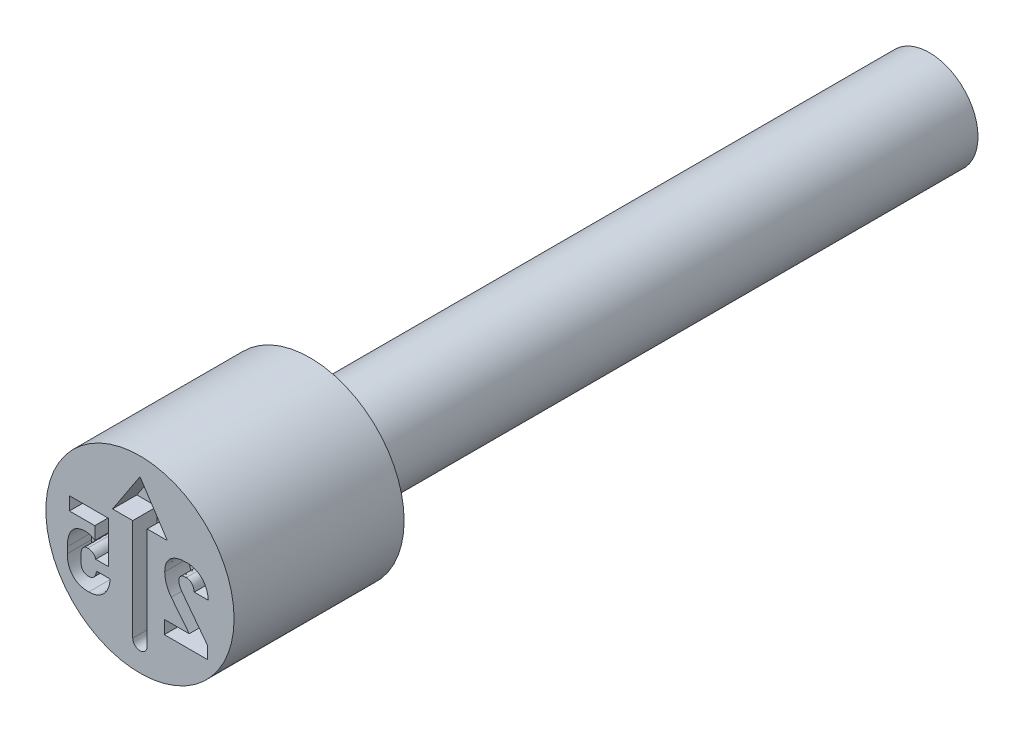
ISO-10303-21;
HEADER;
FILE_DESCRIPTION(('STEP AP214'),'2;1');
FILE_NAME('part.step','',(''),(''),'','','');
FILE_SCHEMA(('AUTOMOTIVE_DESIGN { 1 0 10303 214 1 1 1 1 }'));
ENDSEC;
DATA;
#1=APPLICATION_CONTEXT('core data for automotive mechanical design processes');
#2=APPLICATION_PROTOCOL_DEFINITION('international standard','automotive_design',2000,#1);
#3=PRODUCT_CONTEXT('',#1,'mechanical');
#4=PRODUCT('Part','Part','',(#3));
#5=PRODUCT_RELATED_PRODUCT_CATEGORY('part','',(#4));
#6=PRODUCT_DEFINITION_FORMATION('','',#4);
#7=PRODUCT_DEFINITION_CONTEXT('part definition',#1,'design');
#8=PRODUCT_DEFINITION('design','',#6,#7);
#9=PRODUCT_DEFINITION_SHAPE('','',#8);
#10=(LENGTH_UNIT() NAMED_UNIT(*) SI_UNIT(.MILLI.,.METRE.));
#11=(NAMED_UNIT(*) PLANE_ANGLE_UNIT() SI_UNIT($,.RADIAN.));
#12=(NAMED_UNIT(*) SI_UNIT($,.STERADIAN.) SOLID_ANGLE_UNIT());
#13=UNCERTAINTY_MEASURE_WITH_UNIT(LENGTH_MEASURE(1.E-05),#10,'distance_accuracy_value','');
#14=(GEOMETRIC_REPRESENTATION_CONTEXT(3) GLOBAL_UNCERTAINTY_ASSIGNED_CONTEXT((#13)) GLOBAL_UNIT_ASSIGNED_CONTEXT((#10,
#11,#12)) REPRESENTATION_CONTEXT('',''));
#15=CARTESIAN_POINT('',(0.,0.,0.));
#16=DIRECTION('',(0.,0.,1.));
#17=DIRECTION('',(1.,0.,0.));
#18=AXIS2_PLACEMENT_3D('',#15,#16,#17);
#19=CARTESIAN_POINT('',(0.,0.799999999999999,-2.8));
#20=DIRECTION('',(0.,0.,1.));
#21=DIRECTION('',(1.,0.,0.));
#22=AXIS2_PLACEMENT_3D('',#19,#20,#21);
#23=PLANE('',#22);
#24=CARTESIAN_POINT('',(0.,0.,-2.8));
#25=DIRECTION('',(0.,0.,1.));
#26=DIRECTION('',(1.,0.,0.));
#27=AXIS2_PLACEMENT_3D('',#24,#25,#26);
#28=CIRCLE('',#27,1.55);
#29=CARTESIAN_POINT('',(1.55,0.,-2.8));
#30=VERTEX_POINT('',#29);
#31=EDGE_CURVE('E11',#30,#30,#28,.T.);
#32=ORIENTED_EDGE('',*,*,#31,.F.);
#33=EDGE_LOOP('',(#32));
#34=FACE_BOUND('',#33,.T.);
#35=CARTESIAN_POINT('',(0.,0.,-2.8));
#36=DIRECTION('',(0.,0.,1.));
#37=DIRECTION('',(1.,0.,0.));
#38=AXIS2_PLACEMENT_3D('',#35,#36,#37);
#39=CIRCLE('',#38,0.799999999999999);
#40=CARTESIAN_POINT('',(0.799999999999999,0.,-2.8));
#41=VERTEX_POINT('',#40);
#42=EDGE_CURVE('E572',#41,#41,#39,.T.);
#43=ORIENTED_EDGE('',*,*,#42,.T.);
#44=EDGE_LOOP('',(#43));
#45=FACE_BOUND('',#44,.T.);
#46=ADVANCED_FACE('F35',(#34,#45),#23,.F.);
#47=CARTESIAN_POINT('',(0.,0.,-0.403888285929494));
#48=DIRECTION('',(0.,0.,1.));
#49=DIRECTION('',(1.,0.,0.));
#50=AXIS2_PLACEMENT_3D('',#47,#48,#49);
#51=CYLINDRICAL_SURFACE('',#50,1.55);
#52=CARTESIAN_POINT('',(0.,0.,0.));
#53=DIRECTION('',(0.,0.,1.));
#54=DIRECTION('',(1.,0.,0.));
#55=AXIS2_PLACEMENT_3D('',#52,#53,#54);
#56=CIRCLE('',#55,1.55);
#57=CARTESIAN_POINT('',(1.55,0.,0.));
#58=VERTEX_POINT('',#57);
#59=EDGE_CURVE('E42',#58,#58,#56,.T.);
#60=ORIENTED_EDGE('',*,*,#59,.F.);
#61=EDGE_LOOP('',(#60));
#62=FACE_BOUND('',#61,.T.);
#63=ORIENTED_EDGE('',*,*,#31,.T.);
#64=EDGE_LOOP('',(#63));
#65=FACE_BOUND('',#64,.T.);
#66=ADVANCED_FACE('F594',(#62,#65),#51,.T.);
#67=CARTESIAN_POINT('',(0.,1.55,0.));
#68=DIRECTION('',(0.,0.,-1.));
#69=DIRECTION('',(-1.,0.,0.));
#70=AXIS2_PLACEMENT_3D('',#67,#68,#69);
#71=PLANE('',#70);
#72=DIRECTION('',(-0.60539313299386,0.795926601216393,0.));
#73=VECTOR('',#72,1.);
#74=CARTESIAN_POINT('',(1.11073975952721,-0.596046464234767,0.));
#75=LINE('',#74,#73);
#76=CARTESIAN_POINT('',(1.11073975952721,-0.596046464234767,0.));
#77=VERTEX_POINT('',#76);
#78=CARTESIAN_POINT('',(0.698919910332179,-0.0546158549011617,0.));
#79=VERTEX_POINT('',#78);
#80=EDGE_CURVE('E1034',#77,#79,#75,.T.);
#81=ORIENTED_EDGE('',*,*,#80,.F.);
#82=DIRECTION('',(0.,1.,0.));
#83=VECTOR('',#82,1.);
#84=CARTESIAN_POINT('',(1.11073975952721,-0.8,0.));
#85=LINE('',#84,#83);
#86=CARTESIAN_POINT('',(1.11073975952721,-0.8,0.));
#87=VERTEX_POINT('',#86);
#88=EDGE_CURVE('E49',#87,#77,#85,.T.);
#89=ORIENTED_EDGE('',*,*,#88,.F.);
#90=DIRECTION('',(1.,0.,0.));
#91=VECTOR('',#90,1.);
#92=CARTESIAN_POINT('',(0.401059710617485,-0.8,0.));
#93=LINE('',#92,#91);
#94=CARTESIAN_POINT('',(0.401059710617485,-0.8,0.));
#95=VERTEX_POINT('',#94);
#96=EDGE_CURVE('E330',#95,#87,#93,.T.);
#97=ORIENTED_EDGE('',*,*,#96,.F.);
#98=DIRECTION('',(0.,-1.,0.));
#99=VECTOR('',#98,1.);
#100=CARTESIAN_POINT('',(0.401059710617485,-0.582107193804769,0.));
#101=LINE('',#100,#99);
#102=CARTESIAN_POINT('',(0.401059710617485,-0.582107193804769,0.));
#103=VERTEX_POINT('',#102);
#104=EDGE_CURVE('E333',#103,#95,#101,.T.);
#105=ORIENTED_EDGE('',*,*,#104,.F.);
#106=DIRECTION('',(-1.,0.,0.));
#107=VECTOR('',#106,1.);
#108=CARTESIAN_POINT('',(0.811167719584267,-0.582107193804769,0.));
#109=LINE('',#108,#107);
#110=CARTESIAN_POINT('',(0.811167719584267,-0.582107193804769,0.));
#111=VERTEX_POINT('',#110);
#112=EDGE_CURVE('E1102',#111,#103,#109,.T.);
#113=ORIENTED_EDGE('',*,*,#112,.F.);
#114=DIRECTION('',(0.620676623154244,-0.78406666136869,0.));
#115=VECTOR('',#114,1.);
#116=CARTESIAN_POINT('',(0.515753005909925,-0.208926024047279,0.));
#117=LINE('',#116,#115);
#118=CARTESIAN_POINT('',(0.515753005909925,-0.20892602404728,0.));
#119=VERTEX_POINT('',#118);
#120=EDGE_CURVE('E1096',#119,#111,#117,.T.);
#121=ORIENTED_EDGE('',*,*,#120,.F.);
#122=CARTESIAN_POINT('',(0.407662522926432,0.0987161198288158,0.));
#123=CARTESIAN_POINT('',(0.407976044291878,0.0850857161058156,0.));
#124=CARTESIAN_POINT('',(0.408603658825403,0.0578000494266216,0.));
#125=CARTESIAN_POINT('',(0.414201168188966,0.0170361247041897,0.));
#126=CARTESIAN_POINT('',(0.423353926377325,-0.0234922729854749,0.));
#127=CARTESIAN_POINT('',(0.435772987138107,-0.063643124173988,0.));
#128=CARTESIAN_POINT('',(0.451280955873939,-0.10274599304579,0.));
#129=CARTESIAN_POINT('',(0.469788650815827,-0.140177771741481,0.));
#130=CARTESIAN_POINT('',(0.490918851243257,-0.175842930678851,0.));
#131=CARTESIAN_POINT('',(0.507476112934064,-0.197899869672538,0.));
#132=CARTESIAN_POINT('',(0.515753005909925,-0.20892602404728,0.));
#133=B_SPLINE_CURVE_WITH_KNOTS('',3,(#122,#123,#124,#125,#126,#127,#128,#129,#130,#131,#132),
.UNSPECIFIED.,.F.,.F.,(4,1,1,1,1,1,1,1,4),(0.,0.123148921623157,0.246522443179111,
0.371108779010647,0.498350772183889,0.625999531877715,0.750879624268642,0.875465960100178,1.),.UNSPECIFIED.);
#134=CARTESIAN_POINT('',(0.407662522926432,0.0987161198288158,0.));
#135=VERTEX_POINT('',#134);
#136=EDGE_CURVE('E1091',#135,#119,#133,.T.);
#137=ORIENTED_EDGE('',*,*,#136,.F.);
#138=DIRECTION('',(0.,-1.,0.));
#139=VECTOR('',#138,1.);
#140=CARTESIAN_POINT('',(0.407662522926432,0.099694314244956,0.));
#141=LINE('',#140,#139);
#142=CARTESIAN_POINT('',(0.407662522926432,0.099694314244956,0.));
#143=VERTEX_POINT('',#142);
#144=EDGE_CURVE('E1085',#143,#135,#141,.T.);
#145=ORIENTED_EDGE('',*,*,#144,.F.);
#146=CARTESIAN_POINT('',(0.762502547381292,0.412471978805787,0.));
#147=CARTESIAN_POINT('',(0.744465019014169,0.412094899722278,0.));
#148=CARTESIAN_POINT('',(0.709554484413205,0.411365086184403,0.));
#149=CARTESIAN_POINT('',(0.6592856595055,0.404494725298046,0.));
#150=CARTESIAN_POINT('',(0.613062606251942,0.393061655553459,0.));
#151=CARTESIAN_POINT('',(0.571001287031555,0.376998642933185,0.));
#152=CARTESIAN_POINT('',(0.533377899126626,0.356350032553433,0.));
#153=CARTESIAN_POINT('',(0.500018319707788,0.331840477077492,0.));
#154=CARTESIAN_POINT('',(0.471864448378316,0.302518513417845,0.));
#155=CARTESIAN_POINT('',(0.448445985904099,0.269208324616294,0.));
#156=CARTESIAN_POINT('',(0.429985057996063,0.232038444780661,0.));
#157=CARTESIAN_POINT('',(0.41705693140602,0.191040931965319,0.));
#158=CARTESIAN_POINT('',(0.409139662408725,0.146545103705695,0.));
#159=CARTESIAN_POINT('',(0.408164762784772,0.115623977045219,0.));
#160=CARTESIAN_POINT('',(0.407662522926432,0.099694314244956,0.));
#161=B_SPLINE_CURVE_WITH_KNOTS('',3,(#146,#147,#148,#149,#150,#151,#152,#153,#154,#155,#156,
#157,#158,#159,#160),.UNSPECIFIED.,.F.,.F.,(4,1,1,1,1,1,1,1,1,1,1,1,4),(0.,0.100715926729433,
0.194929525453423,0.2827284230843,0.366191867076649,0.44566981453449,0.521804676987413,
0.596515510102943,0.671682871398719,0.748455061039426,0.827368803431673,0.911065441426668,1.),.UNSPECIFIED.);
#162=CARTESIAN_POINT('',(0.762502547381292,0.412471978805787,0.));
#163=VERTEX_POINT('',#162);
#164=EDGE_CURVE('E1077',#163,#143,#161,.T.);
#165=ORIENTED_EDGE('',*,*,#164,.F.);
#166=CARTESIAN_POINT('',(1.12565722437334,0.0534746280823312,0.));
#167=CARTESIAN_POINT('',(1.12399612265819,0.0715403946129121,0.));
#168=CARTESIAN_POINT('',(1.12076019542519,0.10673360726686,0.));
#169=CARTESIAN_POINT('',(1.10975712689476,0.15734426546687,0.));
#170=CARTESIAN_POINT('',(1.09350240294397,0.203913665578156,0.));
#171=CARTESIAN_POINT('',(1.07273473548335,0.246570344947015,0.));
#172=CARTESIAN_POINT('',(1.04726995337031,0.284775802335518,0.));
#173=CARTESIAN_POINT('',(1.01772322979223,0.318519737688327,0.));
#174=CARTESIAN_POINT('',(0.983767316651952,0.347146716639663,0.));
#175=CARTESIAN_POINT('',(0.945990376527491,0.370934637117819,0.));
#176=CARTESIAN_POINT('',(0.904557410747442,0.389551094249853,0.));
#177=CARTESIAN_POINT('',(0.859975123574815,0.403115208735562,0.));
#178=CARTESIAN_POINT('',(0.812176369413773,0.410934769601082,0.));
#179=CARTESIAN_POINT('',(0.779323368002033,0.41195144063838,0.));
#180=CARTESIAN_POINT('',(0.762502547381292,0.412471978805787,0.));
#181=B_SPLINE_CURVE_WITH_KNOTS('',3,(#166,#167,#168,#169,#170,#171,#172,#173,#174,#175,#176,
#177,#178,#179,#180),.UNSPECIFIED.,.F.,.F.,(4,1,1,1,1,1,1,1,1,1,1,1,4),(0.,0.0953291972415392,
0.185707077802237,0.271513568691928,0.354131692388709,0.434493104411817,0.512233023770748,
0.58917600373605,0.667186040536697,0.746219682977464,0.827302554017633,0.911578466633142,1.),.UNSPECIFIED.);
#182=CARTESIAN_POINT('',(1.12565722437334,0.0534746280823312,0.));
#183=VERTEX_POINT('',#182);
#184=EDGE_CURVE('E1072',#183,#163,#181,.T.);
#185=ORIENTED_EDGE('',*,*,#184,.F.);
#186=DIRECTION('',(0.,1.,0.));
#187=VECTOR('',#186,1.);
#188=CARTESIAN_POINT('',(1.12565722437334,0.052496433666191,0.));
#189=LINE('',#188,#187);
#190=CARTESIAN_POINT('',(1.12565722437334,0.052496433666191,0.));
#191=VERTEX_POINT('',#190);
#192=EDGE_CURVE('E1069',#191,#183,#189,.T.);
#193=ORIENTED_EDGE('',*,*,#192,.F.);
#194=DIRECTION('',(1.,0.,0.));
#195=VECTOR('',#194,1.);
#196=CARTESIAN_POINT('',(0.893825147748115,0.052496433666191,0.));
#197=LINE('',#196,#195);
#198=CARTESIAN_POINT('',(0.893825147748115,0.052496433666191,0.));
#199=VERTEX_POINT('',#198);
#200=EDGE_CURVE('E1066',#199,#191,#197,.T.);
#201=ORIENTED_EDGE('',*,*,#200,.F.);
#202=DIRECTION('',(0.,-1.,0.));
#203=VECTOR('',#202,1.);
#204=CARTESIAN_POINT('',(0.893825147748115,0.0534746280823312,0.));
#205=LINE('',#204,#203);
#206=CARTESIAN_POINT('',(0.893825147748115,0.0534746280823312,0.));
#207=VERTEX_POINT('',#206);
#208=EDGE_CURVE('E1060',#207,#199,#205,.T.);
#209=ORIENTED_EDGE('',*,*,#208,.F.);
#210=CARTESIAN_POINT('',(0.760790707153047,0.194579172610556,0.));
#211=CARTESIAN_POINT('',(0.769721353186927,0.194201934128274,0.));
#212=CARTESIAN_POINT('',(0.787052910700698,0.193469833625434,0.));
#213=CARTESIAN_POINT('',(0.811707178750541,0.186493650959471,0.));
#214=CARTESIAN_POINT('',(0.83360840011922,0.174650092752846,0.));
#215=CARTESIAN_POINT('',(0.852567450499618,0.158282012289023,0.));
#216=CARTESIAN_POINT('',(0.868475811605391,0.137690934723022,0.));
#217=CARTESIAN_POINT('',(0.880201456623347,0.112885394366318,0.));
#218=CARTESIAN_POINT('',(0.889644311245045,0.0846928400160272,0.));
#219=CARTESIAN_POINT('',(0.892384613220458,0.0642310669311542,0.));
#220=CARTESIAN_POINT('',(0.893825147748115,0.0534746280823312,0.));
#221=B_SPLINE_CURVE_WITH_KNOTS('',3,(#210,#211,#212,#213,#214,#215,#216,#217,#218,#219,#220),
.UNSPECIFIED.,.F.,.F.,(4,1,1,1,1,1,1,1,4),(0.,0.124212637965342,0.241057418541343,
0.353359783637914,0.468536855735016,0.587568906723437,0.713021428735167,0.849139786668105,1.),.UNSPECIFIED.);
#222=CARTESIAN_POINT('',(0.760790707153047,0.194579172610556,0.));
#223=VERTEX_POINT('',#222);
#224=EDGE_CURVE('E1052',#223,#207,#221,.T.);
#225=ORIENTED_EDGE('',*,*,#224,.F.);
#226=CARTESIAN_POINT('',(0.640472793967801,0.0930915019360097,0.));
#227=CARTESIAN_POINT('',(0.64080098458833,0.100797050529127,0.));
#228=CARTESIAN_POINT('',(0.641426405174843,0.115481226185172,0.));
#229=CARTESIAN_POINT('',(0.647464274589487,0.136140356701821,0.));
#230=CARTESIAN_POINT('',(0.657448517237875,0.154004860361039,0.));
#231=CARTESIAN_POINT('',(0.671433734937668,0.168980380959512,0.));
#232=CARTESIAN_POINT('',(0.689223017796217,0.180489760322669,0.));
#233=CARTESIAN_POINT('',(0.710206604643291,0.188897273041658,0.));
#234=CARTESIAN_POINT('',(0.734496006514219,0.193654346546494,0.));
#235=CARTESIAN_POINT('',(0.751721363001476,0.194260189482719,0.));
#236=CARTESIAN_POINT('',(0.760790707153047,0.194579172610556,0.));
#237=B_SPLINE_CURVE_WITH_KNOTS('',3,(#226,#227,#228,#229,#230,#231,#232,#233,#234,#235,#236),
.UNSPECIFIED.,.F.,.F.,(4,1,1,1,1,1,1,1,4),(0.,0.129170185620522,0.246154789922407,
0.357734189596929,0.470108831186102,0.586692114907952,0.710769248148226,0.847716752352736,1.),.UNSPECIFIED.);
#238=CARTESIAN_POINT('',(0.640472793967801,0.0930915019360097,0.));
#239=VERTEX_POINT('',#238);
#240=EDGE_CURVE('E1047',#239,#223,#237,.T.);
#241=ORIENTED_EDGE('',*,*,#240,.F.);
#242=DIRECTION('',(0.,1.,0.));
#243=VECTOR('',#242,1.);
#244=CARTESIAN_POINT('',(0.640472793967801,0.0913796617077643,0.));
#245=LINE('',#244,#243);
#246=CARTESIAN_POINT('',(0.640472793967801,0.0913796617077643,0.));
#247=VERTEX_POINT('',#246);
#248=EDGE_CURVE('E1041',#247,#239,#245,.T.);
#249=ORIENTED_EDGE('',*,*,#248,.F.);
#250=CARTESIAN_POINT('',(0.698919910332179,-0.0546158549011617,0.));
#251=CARTESIAN_POINT('',(0.690282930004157,-0.0426328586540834,0.));
#252=CARTESIAN_POINT('',(0.673421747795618,-0.0192395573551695,0.));
#253=CARTESIAN_POINT('',(0.658336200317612,0.0130263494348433,0.));
#254=CARTESIAN_POINT('',(0.648752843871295,0.0383261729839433,0.));
#255=CARTESIAN_POINT('',(0.644322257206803,0.0566782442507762,0.));
#256=CARTESIAN_POINT('',(0.641042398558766,0.0742269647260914,0.));
#257=CARTESIAN_POINT('',(0.64066005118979,0.0857407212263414,0.));
#258=CARTESIAN_POINT('',(0.640472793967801,0.0913796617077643,0.));
#259=B_SPLINE_CURVE_WITH_KNOTS('',3,(#250,#251,#252,#253,#254,#255,#256,#257,#258),
.UNSPECIFIED.,.F.,.F.,(4,1,1,1,1,1,4),(0.,0.276737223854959,0.540248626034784,0.66563356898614,
0.784034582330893,0.894229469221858,1.),.UNSPECIFIED.);
#260=EDGE_CURVE('E1036',#79,#247,#259,.T.);
#261=ORIENTED_EDGE('',*,*,#260,.F.);
#262=EDGE_LOOP('',(#81,#89,#97,#105,#113,#121,#137,#145,#165,#185,#193,#201,#209,#225,#241,#249,#261));
#263=FACE_BOUND('',#262,.T.);
#264=CARTESIAN_POINT('',(-0.842753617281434,-0.812471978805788,0.));
#265=CARTESIAN_POINT('',(-0.826982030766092,-0.811990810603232,0.));
#266=CARTESIAN_POINT('',(-0.796119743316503,-0.811049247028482,0.));
#267=CARTESIAN_POINT('',(-0.751133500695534,-0.802596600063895,0.));
#268=CARTESIAN_POINT('',(-0.708485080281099,-0.789506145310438,0.));
#269=CARTESIAN_POINT('',(-0.668491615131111,-0.77083171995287,0.));
#270=CARTESIAN_POINT('',(-0.631587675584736,-0.747106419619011,0.));
#271=CARTESIAN_POINT('',(-0.598589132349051,-0.718094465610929,0.));
#272=CARTESIAN_POINT('',(-0.569193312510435,-0.684555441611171,0.));
#273=CARTESIAN_POINT('',(-0.543989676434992,-0.646195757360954,0.));
#274=CARTESIAN_POINT('',(-0.523233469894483,-0.603425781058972,0.));
#275=CARTESIAN_POINT('',(-0.507074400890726,-0.556749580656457,0.));
#276=CARTESIAN_POINT('',(-0.495975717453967,-0.506251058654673,0.));
#277=CARTESIAN_POINT('',(-0.492749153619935,-0.471216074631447,0.));
#278=CARTESIAN_POINT('',(-0.49109272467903,-0.453230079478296,0.));
#279=B_SPLINE_CURVE_WITH_KNOTS('',3,(#264,#265,#266,#267,#268,#269,#270,#271,#272,#273,#274,
#275,#276,#277,#278),.UNSPECIFIED.,.F.,.F.,(4,1,1,1,1,1,1,1,1,1,1,1,4),(0.,0.0844304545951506,
0.165215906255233,0.244369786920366,0.322918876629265,0.400936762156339,0.47863123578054,
0.557558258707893,0.639203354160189,0.723781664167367,0.811629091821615,0.903295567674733,1.),.UNSPECIFIED.);
#280=CARTESIAN_POINT('',(-0.842753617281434,-0.812471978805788,0.));
#281=VERTEX_POINT('',#280);
#282=CARTESIAN_POINT('',(-0.49109272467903,-0.453230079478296,0.));
#283=VERTEX_POINT('',#282);
#284=EDGE_CURVE('E397',#281,#283,#279,.T.);
#285=ORIENTED_EDGE('',*,*,#284,.F.);
#286=CARTESIAN_POINT('',(-1.19661544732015,-0.444181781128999,0.));
#287=CARTESIAN_POINT('',(-1.19607974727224,-0.462871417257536,0.));
#288=CARTESIAN_POINT('',(-1.19504341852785,-0.49902711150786,0.));
#289=CARTESIAN_POINT('',(-1.18763258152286,-0.551310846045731,0.));
#290=CARTESIAN_POINT('',(-1.17427293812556,-0.599270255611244,0.));
#291=CARTESIAN_POINT('',(-1.15637298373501,-0.643215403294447,0.));
#292=CARTESIAN_POINT('',(-1.13299937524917,-0.68227302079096,0.));
#293=CARTESIAN_POINT('',(-1.10501086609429,-0.716773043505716,0.));
#294=CARTESIAN_POINT('',(-1.07189669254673,-0.745918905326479,0.));
#295=CARTESIAN_POINT('',(-1.03443836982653,-0.770447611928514,0.));
#296=CARTESIAN_POINT('',(-0.992279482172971,-0.789259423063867,0.));
#297=CARTESIAN_POINT('',(-0.94609372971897,-0.802925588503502,0.));
#298=CARTESIAN_POINT('',(-0.895698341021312,-0.811054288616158,0.));
#299=CARTESIAN_POINT('',(-0.86079934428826,-0.811988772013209,0.));
#300=CARTESIAN_POINT('',(-0.842753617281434,-0.812471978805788,0.));
#301=B_SPLINE_CURVE_WITH_KNOTS('',3,(#286,#287,#288,#289,#290,#291,#292,#293,#294,#295,#296,
#297,#298,#299,#300),.UNSPECIFIED.,.F.,.F.,(4,1,1,1,1,1,1,1,1,1,1,1,4),(0.,0.096591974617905,
0.1868602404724,0.272108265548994,0.353324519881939,0.431359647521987,0.506505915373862,
0.582010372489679,0.6584354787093,0.737063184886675,0.819709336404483,0.906774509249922,1.),.UNSPECIFIED.);
#302=CARTESIAN_POINT('',(-1.19661544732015,-0.444181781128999,0.));
#303=VERTEX_POINT('',#302);
#304=EDGE_CURVE('E57',#303,#281,#301,.T.);
#305=ORIENTED_EDGE('',*,*,#304,.F.);
#306=DIRECTION('',(0.,-1.,0.));
#307=VECTOR('',#306,1.);
#308=CARTESIAN_POINT('',(-1.19661544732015,-0.343672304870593,0.));
#309=LINE('',#308,#307);
#310=CARTESIAN_POINT('',(-1.19661544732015,-0.343672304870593,0.));
#311=VERTEX_POINT('',#310);
#312=EDGE_CURVE('E483',#311,#303,#309,.T.);
#313=ORIENTED_EDGE('',*,*,#312,.F.);
#314=CARTESIAN_POINT('',(-0.901200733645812,0.0236396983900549,0.));
#315=CARTESIAN_POINT('',(-0.91624012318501,0.0231635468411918,0.));
#316=CARTESIAN_POINT('',(-0.945408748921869,0.0222400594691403,0.));
#317=CARTESIAN_POINT('',(-0.987482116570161,0.0139330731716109,0.));
#318=CARTESIAN_POINT('',(-1.02625663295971,0.00062443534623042,0.));
#319=CARTESIAN_POINT('',(-1.06141234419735,-0.01854945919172,0.));
#320=CARTESIAN_POINT('',(-1.09298901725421,-0.0425810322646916,0.));
#321=CARTESIAN_POINT('',(-1.12041574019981,-0.0719456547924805,0.));
#322=CARTESIAN_POINT('',(-1.1438634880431,-0.106164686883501,0.));
#323=CARTESIAN_POINT('',(-1.16305346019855,-0.14526102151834,0.));
#324=CARTESIAN_POINT('',(-1.17815677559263,-0.188892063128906,0.));
#325=CARTESIAN_POINT('',(-1.18912676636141,-0.236753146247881,0.));
#326=CARTESIAN_POINT('',(-1.19537831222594,-0.288890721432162,0.));
#327=CARTESIAN_POINT('',(-1.19619350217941,-0.324988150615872,0.));
#328=CARTESIAN_POINT('',(-1.19661544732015,-0.343672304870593,0.));
#329=B_SPLINE_CURVE_WITH_KNOTS('',3,(#314,#315,#316,#317,#318,#319,#320,#321,#322,#323,#324,
#325,#326,#327,#328),.UNSPECIFIED.,.F.,.F.,(4,1,1,1,1,1,1,1,1,1,1,1,4),(0.,0.084394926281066,
0.163682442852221,0.239848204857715,0.313806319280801,0.3876154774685,0.461788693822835,
0.538496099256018,0.61978489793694,0.70565234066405,0.797279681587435,0.895071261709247,1.),.UNSPECIFIED.);
#330=CARTESIAN_POINT('',(-0.901200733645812,0.0236396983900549,0.));
#331=VERTEX_POINT('',#330);
#332=EDGE_CURVE('E475',#331,#311,#329,.T.);
#333=ORIENTED_EDGE('',*,*,#332,.F.);
#334=CARTESIAN_POINT('',(-0.743711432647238,-0.0299164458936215,0.));
#335=CARTESIAN_POINT('',(-0.748264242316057,-0.0258850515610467,0.));
#336=CARTESIAN_POINT('',(-0.75762972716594,-0.0175921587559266,0.));
#337=CARTESIAN_POINT('',(-0.774003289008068,-0.00706249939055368,0.));
#338=CARTESIAN_POINT('',(-0.792729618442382,0.00188072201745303,0.));
#339=CARTESIAN_POINT('',(-0.820362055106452,0.0121808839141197,0.));
#340=CARTESIAN_POINT('',(-0.856711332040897,0.0213402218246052,0.));
#341=CARTESIAN_POINT('',(-0.886551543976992,0.0228825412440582,0.));
#342=CARTESIAN_POINT('',(-0.901200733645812,0.0236396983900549,0.));
#343=B_SPLINE_CURVE_WITH_KNOTS('',3,(#334,#335,#336,#337,#338,#339,#340,#341,#342),
.UNSPECIFIED.,.F.,.F.,(4,1,1,1,1,1,4),(0.,0.107291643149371,0.220707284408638,0.342410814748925,
0.473179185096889,0.74137254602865,1.),.UNSPECIFIED.);
#344=CARTESIAN_POINT('',(-0.743711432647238,-0.0299164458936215,0.));
#345=VERTEX_POINT('',#344);
#346=EDGE_CURVE('E470',#345,#331,#343,.T.);
#347=ORIENTED_EDGE('',*,*,#346,.F.);
#348=DIRECTION('',(0.,-1.,0.));
#349=VECTOR('',#348,1.);
#350=CARTESIAN_POINT('',(-0.743711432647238,0.182107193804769,0.));
#351=LINE('',#350,#349);
#352=CARTESIAN_POINT('',(-0.743711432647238,0.182107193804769,0.));
#353=VERTEX_POINT('',#352);
#354=EDGE_CURVE('E467',#353,#345,#351,.T.);
#355=ORIENTED_EDGE('',*,*,#354,.F.);
#356=DIRECTION('',(1.,0.,0.));
#357=VECTOR('',#356,1.);
#358=CARTESIAN_POINT('',(-1.16213409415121,0.182107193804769,0.));
#359=LINE('',#358,#357);
#360=CARTESIAN_POINT('',(-1.16213409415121,0.182107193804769,0.));
#361=VERTEX_POINT('',#360);
#362=EDGE_CURVE('E464',#361,#353,#359,.T.);
#363=ORIENTED_EDGE('',*,*,#362,.F.);
#364=DIRECTION('',(0.,-1.,0.));
#365=VECTOR('',#364,1.);
#366=CARTESIAN_POINT('',(-1.16213409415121,0.4,0.));
#367=LINE('',#366,#365);
#368=CARTESIAN_POINT('',(-1.16213409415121,0.4,0.));
#369=VERTEX_POINT('',#368);
#370=EDGE_CURVE('E461',#369,#361,#367,.T.);
#371=ORIENTED_EDGE('',*,*,#370,.F.);
#372=DIRECTION('',(-1.,0.,0.));
#373=VECTOR('',#372,1.);
#374=CARTESIAN_POINT('',(-0.517503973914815,0.4,0.));
#375=LINE('',#374,#373);
#376=CARTESIAN_POINT('',(-0.517503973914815,0.4,0.));
#377=VERTEX_POINT('',#376);
#378=EDGE_CURVE('E458',#377,#369,#375,.T.);
#379=ORIENTED_EDGE('',*,*,#378,.F.);
#380=DIRECTION('',(0.,1.,0.));
#381=VECTOR('',#380,1.);
#382=CARTESIAN_POINT('',(-0.517503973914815,-0.289871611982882,0.));
#383=LINE('',#382,#381);
#384=CARTESIAN_POINT('',(-0.517503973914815,-0.289871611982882,0.));
#385=VERTEX_POINT('',#384);
#386=EDGE_CURVE('E455',#385,#377,#383,.T.);
#387=ORIENTED_EDGE('',*,*,#386,.F.);
#388=DIRECTION('',(1.,0.,0.));
#389=VECTOR('',#388,1.);
#390=CARTESIAN_POINT('',(-0.7287939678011,-0.289871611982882,0.));
#391=LINE('',#390,#389);
#392=CARTESIAN_POINT('',(-0.7287939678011,-0.289871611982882,0.));
#393=VERTEX_POINT('',#392);
#394=EDGE_CURVE('E449',#393,#385,#391,.T.);
#395=ORIENTED_EDGE('',*,*,#394,.F.);
#396=CARTESIAN_POINT('',(-0.859138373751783,-0.195720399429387,0.));
#397=CARTESIAN_POINT('',(-0.851287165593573,-0.195959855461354,0.));
#398=CARTESIAN_POINT('',(-0.83608751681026,-0.196423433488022,0.));
#399=CARTESIAN_POINT('',(-0.814202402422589,-0.201223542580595,0.));
#400=CARTESIAN_POINT('',(-0.794087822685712,-0.209077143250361,0.));
#401=CARTESIAN_POINT('',(-0.775972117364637,-0.220180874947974,0.));
#402=CARTESIAN_POINT('',(-0.759971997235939,-0.233789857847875,0.));
#403=CARTESIAN_POINT('',(-0.746798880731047,-0.250233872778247,0.));
#404=CARTESIAN_POINT('',(-0.735756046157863,-0.268814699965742,0.));
#405=CARTESIAN_POINT('',(-0.731148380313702,-0.282750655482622,0.));
#406=CARTESIAN_POINT('',(-0.7287939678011,-0.289871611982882,0.));
#407=B_SPLINE_CURVE_WITH_KNOTS('',3,(#396,#397,#398,#399,#400,#401,#402,#403,#404,#405,#406),
.UNSPECIFIED.,.F.,.F.,(4,1,1,1,1,1,1,1,4),(0.,0.135635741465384,0.262585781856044,
0.385395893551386,0.507524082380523,0.628507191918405,0.746772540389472,0.870606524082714,1.),.UNSPECIFIED.);
#408=CARTESIAN_POINT('',(-0.859138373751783,-0.195720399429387,0.));
#409=VERTEX_POINT('',#408);
#410=EDGE_CURVE('E441',#409,#393,#407,.T.);
#411=ORIENTED_EDGE('',*,*,#410,.F.);
#412=CARTESIAN_POINT('',(-0.970652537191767,-0.343672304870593,0.));
#413=CARTESIAN_POINT('',(-0.970411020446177,-0.332474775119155,0.));
#414=CARTESIAN_POINT('',(-0.969952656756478,-0.311223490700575,0.));
#415=CARTESIAN_POINT('',(-0.96425062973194,-0.281496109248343,0.));
#416=CARTESIAN_POINT('',(-0.955385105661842,-0.255559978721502,0.));
#417=CARTESIAN_POINT('',(-0.94229196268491,-0.234029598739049,0.));
#418=CARTESIAN_POINT('',(-0.926015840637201,-0.216651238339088,0.));
#419=CARTESIAN_POINT('',(-0.90631972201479,-0.204308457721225,0.));
#420=CARTESIAN_POINT('',(-0.883599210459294,-0.197018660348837,0.));
#421=CARTESIAN_POINT('',(-0.867507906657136,-0.196164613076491,0.));
#422=CARTESIAN_POINT('',(-0.859138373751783,-0.195720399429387,0.));
#423=B_SPLINE_CURVE_WITH_KNOTS('',3,(#412,#413,#414,#415,#416,#417,#418,#419,#420,#421,#422),
.UNSPECIFIED.,.F.,.F.,(4,1,1,1,1,1,1,1,4),(0.,0.160198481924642,0.304033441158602,
0.431843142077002,0.550810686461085,0.662316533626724,0.769888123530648,0.880312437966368,1.),.UNSPECIFIED.);
#424=CARTESIAN_POINT('',(-0.970652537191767,-0.343672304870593,0.));
#425=VERTEX_POINT('',#424);
#426=EDGE_CURVE('E436',#425,#409,#423,.T.);
#427=ORIENTED_EDGE('',*,*,#426,.F.);
#428=DIRECTION('',(0.,1.,0.));
#429=VECTOR('',#428,1.);
#430=CARTESIAN_POINT('',(-0.970652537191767,-0.444181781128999,0.));
#431=LINE('',#430,#429);
#432=CARTESIAN_POINT('',(-0.970652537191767,-0.444181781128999,0.));
#433=VERTEX_POINT('',#432);
#434=EDGE_CURVE('E430',#433,#425,#431,.T.);
#435=ORIENTED_EDGE('',*,*,#434,.F.);
#436=CARTESIAN_POINT('',(-0.84593274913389,-0.592867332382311,0.));
#437=CARTESIAN_POINT('',(-0.855364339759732,-0.592456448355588,0.));
#438=CARTESIAN_POINT('',(-0.873404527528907,-0.59167053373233,0.));
#439=CARTESIAN_POINT('',(-0.898690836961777,-0.584085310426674,0.));
#440=CARTESIAN_POINT('',(-0.920703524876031,-0.571941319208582,0.));
#441=CARTESIAN_POINT('',(-0.938886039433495,-0.554466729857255,0.));
#442=CARTESIAN_POINT('',(-0.953391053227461,-0.532693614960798,0.));
#443=CARTESIAN_POINT('',(-0.963658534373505,-0.506620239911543,0.));
#444=CARTESIAN_POINT('',(-0.969739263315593,-0.476660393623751,0.));
#445=CARTESIAN_POINT('',(-0.97033765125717,-0.455380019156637,0.));
#446=CARTESIAN_POINT('',(-0.970652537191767,-0.444181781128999,0.));
#447=B_SPLINE_CURVE_WITH_KNOTS('',3,(#436,#437,#438,#439,#440,#441,#442,#443,#444,#445,#446),
.UNSPECIFIED.,.F.,.F.,(4,1,1,1,1,1,1,1,4),(0.,0.128261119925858,0.245330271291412,
0.356275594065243,0.467886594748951,0.585607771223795,0.710231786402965,0.847517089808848,1.),.UNSPECIFIED.);
#448=CARTESIAN_POINT('',(-0.84593274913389,-0.592867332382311,0.));
#449=VERTEX_POINT('',#448);
#450=EDGE_CURVE('E422',#449,#433,#447,.T.);
#451=ORIENTED_EDGE('',*,*,#450,.F.);
#452=CARTESIAN_POINT('',(-0.717300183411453,-0.453230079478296,0.));
#453=CARTESIAN_POINT('',(-0.71859153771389,-0.463733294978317,0.));
#454=CARTESIAN_POINT('',(-0.721052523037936,-0.483749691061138,0.));
#455=CARTESIAN_POINT('',(-0.729926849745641,-0.511526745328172,0.));
#456=CARTESIAN_POINT('',(-0.741512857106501,-0.535942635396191,0.));
#457=CARTESIAN_POINT('',(-0.756817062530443,-0.556429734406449,0.));
#458=CARTESIAN_POINT('',(-0.774990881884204,-0.573062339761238,0.));
#459=CARTESIAN_POINT('',(-0.796526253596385,-0.584342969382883,0.));
#460=CARTESIAN_POINT('',(-0.820327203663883,-0.591870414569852,0.));
#461=CARTESIAN_POINT('',(-0.83723133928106,-0.592528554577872,0.));
#462=CARTESIAN_POINT('',(-0.84593274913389,-0.592867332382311,0.));
#463=B_SPLINE_CURVE_WITH_KNOTS('',3,(#452,#453,#454,#455,#456,#457,#458,#459,#460,#461,#462),
.UNSPECIFIED.,.F.,.F.,(4,1,1,1,1,1,1,1,4),(0.,0.150277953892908,0.286390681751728,
0.412971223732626,0.533144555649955,0.648163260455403,0.760273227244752,0.87660055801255,1.),.UNSPECIFIED.);
#464=CARTESIAN_POINT('',(-0.717300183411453,-0.453230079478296,0.));
#465=VERTEX_POINT('',#464);
#466=EDGE_CURVE('E417',#465,#449,#463,.T.);
#467=ORIENTED_EDGE('',*,*,#466,.F.);
#468=DIRECTION('',(0.,-1.,0.));
#469=VECTOR('',#468,1.);
#470=CARTESIAN_POINT('',(-0.717300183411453,-0.452496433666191,0.));
#471=LINE('',#470,#469);
#472=CARTESIAN_POINT('',(-0.717300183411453,-0.452496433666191,0.));
#473=VERTEX_POINT('',#472);
#474=EDGE_CURVE('E414',#473,#465,#471,.T.);
#475=ORIENTED_EDGE('',*,*,#474,.F.);
#476=DIRECTION('',(-1.,0.,0.));
#477=VECTOR('',#476,1.);
#478=CARTESIAN_POINT('',(-0.49109272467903,-0.452496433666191,0.));
#479=LINE('',#478,#477);
#480=CARTESIAN_POINT('',(-0.49109272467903,-0.452496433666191,0.));
#481=VERTEX_POINT('',#480);
#482=EDGE_CURVE('E411',#481,#473,#479,.T.);
#483=ORIENTED_EDGE('',*,*,#482,.F.);
#484=DIRECTION('',(0.,1.,0.));
#485=VECTOR('',#484,1.);
#486=CARTESIAN_POINT('',(-0.49109272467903,-0.453230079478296,0.));
#487=LINE('',#486,#485);
#488=EDGE_CURVE('E405',#283,#481,#487,.T.);
#489=ORIENTED_EDGE('',*,*,#488,.F.);
#490=EDGE_LOOP('',(#285,#305,#313,#333,#347,#355,#363,#371,#379,#387,#395,#411,#427,#435,#451,
#467,#475,#483,#489));
#491=FACE_BOUND('',#490,.T.);
#492=DIRECTION('',(0.,1.,0.));
#493=VECTOR('',#492,1.);
#494=CARTESIAN_POINT('',(0.119045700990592,0.566469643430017,0.));
#495=LINE('',#494,#493);
#496=CARTESIAN_POINT('',(0.119045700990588,-1.11010114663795,0.));
#497=VERTEX_POINT('',#496);
#498=CARTESIAN_POINT('',(0.119045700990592,0.566469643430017,0.));
#499=VERTEX_POINT('',#498);
#500=EDGE_CURVE('E552',#497,#499,#495,.T.);
#501=ORIENTED_EDGE('',*,*,#500,.F.);
#502=CARTESIAN_POINT('',(1.02140308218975E-13,-1.11010114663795,0.));
#503=DIRECTION('',(0.,0.,1.));
#504=DIRECTION('',(1.,0.,0.));
#505=AXIS2_PLACEMENT_3D('',#502,#503,#504);
#506=CIRCLE('',#505,0.119045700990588);
#507=CARTESIAN_POINT('',(-0.119045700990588,-1.11010114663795,0.));
#508=VERTEX_POINT('',#507);
#509=EDGE_CURVE('E550',#508,#497,#506,.T.);
#510=ORIENTED_EDGE('',*,*,#509,.F.);
#511=DIRECTION('',(0.,-1.,0.));
#512=VECTOR('',#511,1.);
#513=CARTESIAN_POINT('',(-0.119045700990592,0.566469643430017,0.));
#514=LINE('',#513,#512);
#515=CARTESIAN_POINT('',(-0.119045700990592,0.566469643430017,0.));
#516=VERTEX_POINT('',#515);
#517=EDGE_CURVE('E531',#516,#508,#514,.T.);
#518=ORIENTED_EDGE('',*,*,#517,.F.);
#519=DIRECTION('',(1.,0.,0.));
#520=VECTOR('',#519,1.);
#521=CARTESIAN_POINT('',(-0.451198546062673,0.566469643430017,0.));
#522=LINE('',#521,#520);
#523=CARTESIAN_POINT('',(-0.451198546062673,0.566469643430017,0.));
#524=VERTEX_POINT('',#523);
#525=EDGE_CURVE('E565',#524,#516,#522,.T.);
#526=ORIENTED_EDGE('',*,*,#525,.F.);
#527=DIRECTION('',(-0.550159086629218,-0.835059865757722,0.));
#528=VECTOR('',#527,1.);
#529=CARTESIAN_POINT('',(0.,1.25132209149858,0.));
#530=LINE('',#529,#528);
#531=CARTESIAN_POINT('',(0.,1.25132209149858,0.));
#532=VERTEX_POINT('',#531);
#533=EDGE_CURVE('E562',#532,#524,#530,.T.);
#534=ORIENTED_EDGE('',*,*,#533,.F.);
#535=DIRECTION('',(-0.550159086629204,0.835059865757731,0.));
#536=VECTOR('',#535,1.);
#537=CARTESIAN_POINT('',(0.,1.25132209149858,0.));
#538=LINE('',#537,#536);
#539=CARTESIAN_POINT('',(0.451198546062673,0.566469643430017,0.));
#540=VERTEX_POINT('',#539);
#541=EDGE_CURVE('E559',#540,#532,#538,.T.);
#542=ORIENTED_EDGE('',*,*,#541,.F.);
#543=DIRECTION('',(1.,0.,0.));
#544=VECTOR('',#543,1.);
#545=CARTESIAN_POINT('',(0.451198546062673,0.566469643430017,0.));
#546=LINE('',#545,#544);
#547=EDGE_CURVE('E556',#499,#540,#546,.T.);
#548=ORIENTED_EDGE('',*,*,#547,.F.);
#549=EDGE_LOOP('',(#501,#510,#518,#526,#534,#542,#548));
#550=FACE_BOUND('',#549,.T.);
#551=ORIENTED_EDGE('',*,*,#59,.T.);
#552=EDGE_LOOP('',(#551));
#553=FACE_BOUND('',#552,.T.);
#554=ADVANCED_FACE('F592',(#263,#491,#550,#553),#71,.F.);
#555=CARTESIAN_POINT('',(0.,0.,-13.));
#556=DIRECTION('',(0.,0.,1.));
#557=DIRECTION('',(1.,0.,0.));
#558=AXIS2_PLACEMENT_3D('',#555,#556,#557);
#559=PLANE('',#558);
#560=CARTESIAN_POINT('',(0.,0.,-13.));
#561=DIRECTION('',(0.,0.,1.));
#562=DIRECTION('',(1.,0.,0.));
#563=AXIS2_PLACEMENT_3D('',#560,#561,#562);
#564=CIRCLE('',#563,0.8);
#565=CARTESIAN_POINT('',(0.8,0.,-13.));
#566=VERTEX_POINT('',#565);
#567=EDGE_CURVE('E587',#566,#566,#564,.T.);
#568=ORIENTED_EDGE('',*,*,#567,.F.);
#569=EDGE_LOOP('',(#568));
#570=FACE_BOUND('',#569,.T.);
#571=ADVANCED_FACE('F607',(#570),#559,.F.);
#572=CARTESIAN_POINT('',(0.,0.,-0.403888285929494));
#573=DIRECTION('',(0.,0.,1.));
#574=DIRECTION('',(1.,0.,0.));
#575=AXIS2_PLACEMENT_3D('',#572,#573,#574);
#576=CYLINDRICAL_SURFACE('',#575,0.8);
#577=ORIENTED_EDGE('',*,*,#42,.F.);
#578=EDGE_LOOP('',(#577));
#579=FACE_BOUND('',#578,.T.);
#580=ORIENTED_EDGE('',*,*,#567,.T.);
#581=EDGE_LOOP('',(#580));
#582=FACE_BOUND('',#581,.T.);
#583=ADVANCED_FACE('F603',(#579,#582),#576,.T.);
#584=CARTESIAN_POINT('',(1.02140308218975E-13,-1.11010114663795,-0.4));
#585=DIRECTION('',(0.,0.,1.));
#586=DIRECTION('',(1.,0.,0.));
#587=AXIS2_PLACEMENT_3D('',#584,#585,#586);
#588=CYLINDRICAL_SURFACE('',#587,0.119045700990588);
#589=ORIENTED_EDGE('',*,*,#509,.T.);
#590=DIRECTION('',(0.,0.,1.));
#591=VECTOR('',#590,1.);
#592=CARTESIAN_POINT('',(0.119045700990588,-1.11010114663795,-0.4));
#593=LINE('',#592,#591);
#594=CARTESIAN_POINT('',(0.119045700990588,-1.11010114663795,-0.4));
#595=VERTEX_POINT('',#594);
#596=EDGE_CURVE('E549',#595,#497,#593,.T.);
#597=ORIENTED_EDGE('',*,*,#596,.F.);
#598=CARTESIAN_POINT('',(1.02140308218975E-13,-1.11010114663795,-0.4));
#599=DIRECTION('',(0.,0.,1.));
#600=DIRECTION('',(1.,0.,0.));
#601=AXIS2_PLACEMENT_3D('',#598,#599,#600);
#602=CIRCLE('',#601,0.119045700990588);
#603=CARTESIAN_POINT('',(-0.119045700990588,-1.11010114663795,-0.4));
#604=VERTEX_POINT('',#603);
#605=EDGE_CURVE('E527',#604,#595,#602,.T.);
#606=ORIENTED_EDGE('',*,*,#605,.F.);
#607=DIRECTION('',(0.,0.,1.));
#608=VECTOR('',#607,1.);
#609=CARTESIAN_POINT('',(-0.119045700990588,-1.11010114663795,-0.4));
#610=LINE('',#609,#608);
#611=EDGE_CURVE('E570',#604,#508,#610,.T.);
#612=ORIENTED_EDGE('',*,*,#611,.T.);
#613=EDGE_LOOP('',(#589,#597,#606,#612));
#614=FACE_BOUND('',#613,.T.);
#615=ADVANCED_FACE('F606',(#614),#588,.F.);
#616=CARTESIAN_POINT('',(-0.119045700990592,0.566469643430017,-0.4));
#617=DIRECTION('',(-1.,0.,0.));
#618=DIRECTION('',(0.,-1.,0.));
#619=AXIS2_PLACEMENT_3D('',#616,#617,#618);
#620=PLANE('',#619);
#621=ORIENTED_EDGE('',*,*,#517,.T.);
#622=ORIENTED_EDGE('',*,*,#611,.F.);
#623=DIRECTION('',(0.,-1.,0.));
#624=VECTOR('',#623,1.);
#625=CARTESIAN_POINT('',(-0.119045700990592,0.566469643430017,-0.4));
#626=LINE('',#625,#624);
#627=CARTESIAN_POINT('',(-0.119045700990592,0.566469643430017,-0.4));
#628=VERTEX_POINT('',#627);
#629=EDGE_CURVE('E546',#628,#604,#626,.T.);
#630=ORIENTED_EDGE('',*,*,#629,.F.);
#631=DIRECTION('',(0.,0.,1.));
#632=VECTOR('',#631,1.);
#633=CARTESIAN_POINT('',(-0.119045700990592,0.566469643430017,-0.4));
#634=LINE('',#633,#632);
#635=EDGE_CURVE('E573',#628,#516,#634,.T.);
#636=ORIENTED_EDGE('',*,*,#635,.T.);
#637=EDGE_LOOP('',(#621,#622,#630,#636));
#638=FACE_BOUND('',#637,.T.);
#639=ADVANCED_FACE('F621',(#638),#620,.F.);
#640=CARTESIAN_POINT('',(-0.451198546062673,0.566469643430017,-0.4));
#641=DIRECTION('',(0.,-1.,0.));
#642=DIRECTION('',(0.,0.,-1.));
#643=AXIS2_PLACEMENT_3D('',#640,#641,#642);
#644=PLANE('',#643);
#645=ORIENTED_EDGE('',*,*,#525,.T.);
#646=ORIENTED_EDGE('',*,*,#635,.F.);
#647=DIRECTION('',(1.,0.,0.));
#648=VECTOR('',#647,1.);
#649=CARTESIAN_POINT('',(-0.451198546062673,0.566469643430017,-0.4));
#650=LINE('',#649,#648);
#651=CARTESIAN_POINT('',(-0.451198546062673,0.566469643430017,-0.4));
#652=VERTEX_POINT('',#651);
#653=EDGE_CURVE('E543',#652,#628,#650,.T.);
#654=ORIENTED_EDGE('',*,*,#653,.F.);
#655=DIRECTION('',(0.,0.,1.));
#656=VECTOR('',#655,1.);
#657=CARTESIAN_POINT('',(-0.451198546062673,0.566469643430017,-0.4));
#658=LINE('',#657,#656);
#659=EDGE_CURVE('E575',#652,#524,#658,.T.);
#660=ORIENTED_EDGE('',*,*,#659,.T.);
#661=EDGE_LOOP('',(#645,#646,#654,#660));
#662=FACE_BOUND('',#661,.T.);
#663=ADVANCED_FACE('F639',(#662),#644,.F.);
#664=CARTESIAN_POINT('',(0.,1.25132209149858,-0.4));
#665=DIRECTION('',(-0.835059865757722,0.550159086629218,0.));
#666=DIRECTION('',(-0.550159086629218,-0.835059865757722,0.));
#667=AXIS2_PLACEMENT_3D('',#664,#665,#666);
#668=PLANE('',#667);
#669=ORIENTED_EDGE('',*,*,#533,.T.);
#670=ORIENTED_EDGE('',*,*,#659,.F.);
#671=DIRECTION('',(-0.550159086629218,-0.835059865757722,0.));
#672=VECTOR('',#671,1.);
#673=CARTESIAN_POINT('',(0.,1.25132209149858,-0.4));
#674=LINE('',#673,#672);
#675=CARTESIAN_POINT('',(0.,1.25132209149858,-0.4));
#676=VERTEX_POINT('',#675);
#677=EDGE_CURVE('E540',#676,#652,#674,.T.);
#678=ORIENTED_EDGE('',*,*,#677,.F.);
#679=DIRECTION('',(0.,0.,1.));
#680=VECTOR('',#679,1.);
#681=CARTESIAN_POINT('',(0.,1.25132209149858,-0.4));
#682=LINE('',#681,#680);
#683=EDGE_CURVE('E577',#676,#532,#682,.T.);
#684=ORIENTED_EDGE('',*,*,#683,.T.);
#685=EDGE_LOOP('',(#669,#670,#678,#684));
#686=FACE_BOUND('',#685,.T.);
#687=ADVANCED_FACE('F635',(#686),#668,.F.);
#688=CARTESIAN_POINT('',(0.,1.25132209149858,-0.4));
#689=DIRECTION('',(0.835059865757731,0.550159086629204,0.));
#690=DIRECTION('',(-0.550159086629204,0.835059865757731,0.));
#691=AXIS2_PLACEMENT_3D('',#688,#689,#690);
#692=PLANE('',#691);
#693=ORIENTED_EDGE('',*,*,#541,.T.);
#694=ORIENTED_EDGE('',*,*,#683,.F.);
#695=DIRECTION('',(-0.550159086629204,0.835059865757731,0.));
#696=VECTOR('',#695,1.);
#697=CARTESIAN_POINT('',(0.,1.25132209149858,-0.4));
#698=LINE('',#697,#696);
#699=CARTESIAN_POINT('',(0.451198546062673,0.566469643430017,-0.4));
#700=VERTEX_POINT('',#699);
#701=EDGE_CURVE('E537',#700,#676,#698,.T.);
#702=ORIENTED_EDGE('',*,*,#701,.F.);
#703=DIRECTION('',(0.,0.,1.));
#704=VECTOR('',#703,1.);
#705=CARTESIAN_POINT('',(0.451198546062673,0.566469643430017,-0.4));
#706=LINE('',#705,#704);
#707=EDGE_CURVE('E579',#700,#540,#706,.T.);
#708=ORIENTED_EDGE('',*,*,#707,.T.);
#709=EDGE_LOOP('',(#693,#694,#702,#708));
#710=FACE_BOUND('',#709,.T.);
#711=ADVANCED_FACE('F631',(#710),#692,.F.);
#712=CARTESIAN_POINT('',(0.451198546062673,0.566469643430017,-0.4));
#713=DIRECTION('',(0.,-1.,0.));
#714=DIRECTION('',(0.,0.,-1.));
#715=AXIS2_PLACEMENT_3D('',#712,#713,#714);
#716=PLANE('',#715);
#717=ORIENTED_EDGE('',*,*,#547,.T.);
#718=ORIENTED_EDGE('',*,*,#707,.F.);
#719=DIRECTION('',(1.,0.,0.));
#720=VECTOR('',#719,1.);
#721=CARTESIAN_POINT('',(0.451198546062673,0.566469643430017,-0.4));
#722=LINE('',#721,#720);
#723=CARTESIAN_POINT('',(0.119045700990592,0.566469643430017,-0.4));
#724=VERTEX_POINT('',#723);
#725=EDGE_CURVE('E534',#724,#700,#722,.T.);
#726=ORIENTED_EDGE('',*,*,#725,.F.);
#727=DIRECTION('',(0.,0.,1.));
#728=VECTOR('',#727,1.);
#729=CARTESIAN_POINT('',(0.119045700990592,0.566469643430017,-0.4));
#730=LINE('',#729,#728);
#731=EDGE_CURVE('E581',#724,#499,#730,.T.);
#732=ORIENTED_EDGE('',*,*,#731,.T.);
#733=EDGE_LOOP('',(#717,#718,#726,#732));
#734=FACE_BOUND('',#733,.T.);
#735=ADVANCED_FACE('F627',(#734),#716,.F.);
#736=CARTESIAN_POINT('',(0.119045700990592,0.566469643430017,-0.4));
#737=DIRECTION('',(1.,0.,0.));
#738=DIRECTION('',(0.,1.,0.));
#739=AXIS2_PLACEMENT_3D('',#736,#737,#738);
#740=PLANE('',#739);
#741=ORIENTED_EDGE('',*,*,#500,.T.);
#742=ORIENTED_EDGE('',*,*,#731,.F.);
#743=DIRECTION('',(0.,1.,0.));
#744=VECTOR('',#743,1.);
#745=CARTESIAN_POINT('',(0.119045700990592,0.566469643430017,-0.4));
#746=LINE('',#745,#744);
#747=EDGE_CURVE('E530',#595,#724,#746,.T.);
#748=ORIENTED_EDGE('',*,*,#747,.F.);
#749=ORIENTED_EDGE('',*,*,#596,.T.);
#750=EDGE_LOOP('',(#741,#742,#748,#749));
#751=FACE_BOUND('',#750,.T.);
#752=ADVANCED_FACE('F623',(#751),#740,.F.);
#753=CARTESIAN_POINT('',(1.02140308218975E-13,-1.11010114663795,-0.4));
#754=DIRECTION('',(0.,0.,1.));
#755=DIRECTION('',(1.,0.,0.));
#756=AXIS2_PLACEMENT_3D('',#753,#754,#755);
#757=PLANE('',#756);
#758=ORIENTED_EDGE('',*,*,#605,.T.);
#759=ORIENTED_EDGE('',*,*,#747,.T.);
#760=ORIENTED_EDGE('',*,*,#725,.T.);
#761=ORIENTED_EDGE('',*,*,#701,.T.);
#762=ORIENTED_EDGE('',*,*,#677,.T.);
#763=ORIENTED_EDGE('',*,*,#653,.T.);
#764=ORIENTED_EDGE('',*,*,#629,.T.);
#765=EDGE_LOOP('',(#758,#759,#760,#761,#762,#763,#764));
#766=FACE_BOUND('',#765,.T.);
#767=ADVANCED_FACE('F626',(#766),#757,.T.);
#768=CARTESIAN_POINT('',(-1.19661544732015,-0.444181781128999,-0.4));
#769=CARTESIAN_POINT('',(-1.19607974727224,-0.462871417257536,-0.4));
#770=CARTESIAN_POINT('',(-1.19504341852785,-0.49902711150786,-0.4));
#771=CARTESIAN_POINT('',(-1.18763258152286,-0.551310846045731,-0.4));
#772=CARTESIAN_POINT('',(-1.17427293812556,-0.599270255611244,-0.4));
#773=CARTESIAN_POINT('',(-1.15637298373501,-0.643215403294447,-0.4));
#774=CARTESIAN_POINT('',(-1.13299937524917,-0.68227302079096,-0.4));
#775=CARTESIAN_POINT('',(-1.10501086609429,-0.716773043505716,-0.4));
#776=CARTESIAN_POINT('',(-1.07189669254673,-0.745918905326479,-0.4));
#777=CARTESIAN_POINT('',(-1.03443836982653,-0.770447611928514,-0.4));
#778=CARTESIAN_POINT('',(-0.992279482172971,-0.789259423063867,-0.4));
#779=CARTESIAN_POINT('',(-0.94609372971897,-0.802925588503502,-0.4));
#780=CARTESIAN_POINT('',(-0.895698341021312,-0.811054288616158,-0.4));
#781=CARTESIAN_POINT('',(-0.86079934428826,-0.811988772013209,-0.4));
#782=CARTESIAN_POINT('',(-0.842753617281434,-0.812471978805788,-0.4));
#783=B_SPLINE_CURVE_WITH_KNOTS('',3,(#768,#769,#770,#771,#772,#773,#774,#775,#776,#777,#778,
#779,#780,#781,#782),.UNSPECIFIED.,.F.,.F.,(4,1,1,1,1,1,1,1,1,1,1,1,4),(0.,0.096591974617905,
0.1868602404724,0.272108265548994,0.353324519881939,0.431359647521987,0.506505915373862,
0.582010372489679,0.6584354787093,0.737063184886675,0.819709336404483,0.906774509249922,1.),.UNSPECIFIED.);
#784=DIRECTION('',(0.,0.,1.));
#785=VECTOR('',#784,1.);
#786=SURFACE_OF_LINEAR_EXTRUSION('',#783,#785);
#787=ORIENTED_EDGE('',*,*,#304,.T.);
#788=DIRECTION('',(0.,0.,1.));
#789=VECTOR('',#788,1.);
#790=CARTESIAN_POINT('',(-0.842753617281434,-0.812471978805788,-0.4));
#791=LINE('',#790,#789);
#792=CARTESIAN_POINT('',(-0.842753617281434,-0.812471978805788,-0.4));
#793=VERTEX_POINT('',#792);
#794=EDGE_CURVE('E393',#793,#281,#791,.T.);
#795=ORIENTED_EDGE('',*,*,#794,.F.);
#796=CARTESIAN_POINT('',(-1.19661544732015,-0.444181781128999,-0.4));
#797=VERTEX_POINT('',#796);
#798=EDGE_CURVE('E489',#797,#793,#783,.T.);
#799=ORIENTED_EDGE('',*,*,#798,.F.);
#800=DIRECTION('',(0.,0.,1.));
#801=VECTOR('',#800,1.);
#802=CARTESIAN_POINT('',(-1.19661544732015,-0.444181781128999,-0.4));
#803=LINE('',#802,#801);
#804=EDGE_CURVE('E490',#797,#303,#803,.T.);
#805=ORIENTED_EDGE('',*,*,#804,.T.);
#806=EDGE_LOOP('',(#787,#795,#799,#805));
#807=FACE_BOUND('',#806,.T.);
#808=ADVANCED_FACE('F367',(#807),#786,.F.);
#809=CARTESIAN_POINT('',(-1.19661544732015,-0.343672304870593,-0.4));
#810=DIRECTION('',(-1.,0.,0.));
#811=DIRECTION('',(0.,0.,1.));
#812=AXIS2_PLACEMENT_3D('',#809,#810,#811);
#813=PLANE('',#812);
#814=ORIENTED_EDGE('',*,*,#312,.T.);
#815=ORIENTED_EDGE('',*,*,#804,.F.);
#816=DIRECTION('',(0.,-1.,0.));
#817=VECTOR('',#816,1.);
#818=CARTESIAN_POINT('',(-1.19661544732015,-0.343672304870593,-0.4));
#819=LINE('',#818,#817);
#820=CARTESIAN_POINT('',(-1.19661544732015,-0.343672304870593,-0.4));
#821=VERTEX_POINT('',#820);
#822=EDGE_CURVE('E382',#821,#797,#819,.T.);
#823=ORIENTED_EDGE('',*,*,#822,.F.);
#824=DIRECTION('',(0.,0.,1.));
#825=VECTOR('',#824,1.);
#826=CARTESIAN_POINT('',(-1.19661544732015,-0.343672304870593,-0.4));
#827=LINE('',#826,#825);
#828=EDGE_CURVE('E492',#821,#311,#827,.T.);
#829=ORIENTED_EDGE('',*,*,#828,.T.);
#830=EDGE_LOOP('',(#814,#815,#823,#829));
#831=FACE_BOUND('',#830,.T.);
#832=ADVANCED_FACE('F363',(#831),#813,.F.);
#833=CARTESIAN_POINT('',(-0.901200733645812,0.0236396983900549,-0.4));
#834=CARTESIAN_POINT('',(-0.91624012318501,0.0231635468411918,-0.4));
#835=CARTESIAN_POINT('',(-0.945408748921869,0.0222400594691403,-0.4));
#836=CARTESIAN_POINT('',(-0.987482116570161,0.0139330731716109,-0.4));
#837=CARTESIAN_POINT('',(-1.02625663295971,0.00062443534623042,-0.4));
#838=CARTESIAN_POINT('',(-1.06141234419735,-0.01854945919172,-0.4));
#839=CARTESIAN_POINT('',(-1.09298901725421,-0.0425810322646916,-0.4));
#840=CARTESIAN_POINT('',(-1.12041574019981,-0.0719456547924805,-0.4));
#841=CARTESIAN_POINT('',(-1.1438634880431,-0.106164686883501,-0.4));
#842=CARTESIAN_POINT('',(-1.16305346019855,-0.14526102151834,-0.4));
#843=CARTESIAN_POINT('',(-1.17815677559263,-0.188892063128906,-0.4));
#844=CARTESIAN_POINT('',(-1.18912676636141,-0.236753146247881,-0.4));
#845=CARTESIAN_POINT('',(-1.19537831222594,-0.288890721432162,-0.4));
#846=CARTESIAN_POINT('',(-1.19619350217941,-0.324988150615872,-0.4));
#847=CARTESIAN_POINT('',(-1.19661544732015,-0.343672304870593,-0.4));
#848=B_SPLINE_CURVE_WITH_KNOTS('',3,(#833,#834,#835,#836,#837,#838,#839,#840,#841,#842,#843,
#844,#845,#846,#847),.UNSPECIFIED.,.F.,.F.,(4,1,1,1,1,1,1,1,1,1,1,1,4),(0.,0.084394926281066,
0.163682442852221,0.239848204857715,0.313806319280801,0.3876154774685,0.461788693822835,
0.538496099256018,0.61978489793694,0.70565234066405,0.797279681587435,0.895071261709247,1.),.UNSPECIFIED.);
#849=DIRECTION('',(0.,0.,1.));
#850=VECTOR('',#849,1.);
#851=SURFACE_OF_LINEAR_EXTRUSION('',#848,#850);
#852=ORIENTED_EDGE('',*,*,#332,.T.);
#853=ORIENTED_EDGE('',*,*,#828,.F.);
#854=CARTESIAN_POINT('',(-0.901200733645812,0.0236396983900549,-0.4));
#855=VERTEX_POINT('',#854);
#856=EDGE_CURVE('E376',#855,#821,#848,.T.);
#857=ORIENTED_EDGE('',*,*,#856,.F.);
#858=DIRECTION('',(0.,0.,1.));
#859=VECTOR('',#858,1.);
#860=CARTESIAN_POINT('',(-0.901200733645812,0.0236396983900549,-0.4));
#861=LINE('',#860,#859);
#862=EDGE_CURVE('E494',#855,#331,#861,.T.);
#863=ORIENTED_EDGE('',*,*,#862,.T.);
#864=EDGE_LOOP('',(#852,#853,#857,#863));
#865=FACE_BOUND('',#864,.T.);
#866=ADVANCED_FACE('F366',(#865),#851,.F.);
#867=CARTESIAN_POINT('',(-0.743711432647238,-0.0299164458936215,-0.4));
#868=CARTESIAN_POINT('',(-0.748264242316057,-0.0258850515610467,-0.4));
#869=CARTESIAN_POINT('',(-0.75762972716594,-0.0175921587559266,-0.4));
#870=CARTESIAN_POINT('',(-0.774003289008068,-0.00706249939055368,-0.4));
#871=CARTESIAN_POINT('',(-0.792729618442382,0.00188072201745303,-0.4));
#872=CARTESIAN_POINT('',(-0.820362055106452,0.0121808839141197,-0.4));
#873=CARTESIAN_POINT('',(-0.856711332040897,0.0213402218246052,-0.4));
#874=CARTESIAN_POINT('',(-0.886551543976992,0.0228825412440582,-0.4));
#875=CARTESIAN_POINT('',(-0.901200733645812,0.0236396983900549,-0.4));
#876=B_SPLINE_CURVE_WITH_KNOTS('',3,(#867,#868,#869,#870,#871,#872,#873,#874,#875),
.UNSPECIFIED.,.F.,.F.,(4,1,1,1,1,1,4),(0.,0.107291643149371,0.220707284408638,0.342410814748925,
0.473179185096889,0.74137254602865,1.),.UNSPECIFIED.);
#877=DIRECTION('',(0.,0.,1.));
#878=VECTOR('',#877,1.);
#879=SURFACE_OF_LINEAR_EXTRUSION('',#876,#878);
#880=ORIENTED_EDGE('',*,*,#346,.T.);
#881=ORIENTED_EDGE('',*,*,#862,.F.);
#882=CARTESIAN_POINT('',(-0.743711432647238,-0.0299164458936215,-0.4));
#883=VERTEX_POINT('',#882);
#884=EDGE_CURVE('E383',#883,#855,#876,.T.);
#885=ORIENTED_EDGE('',*,*,#884,.F.);
#886=DIRECTION('',(0.,0.,1.));
#887=VECTOR('',#886,1.);
#888=CARTESIAN_POINT('',(-0.743711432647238,-0.0299164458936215,-0.4));
#889=LINE('',#888,#887);
#890=EDGE_CURVE('E496',#883,#345,#889,.T.);
#891=ORIENTED_EDGE('',*,*,#890,.T.);
#892=EDGE_LOOP('',(#880,#881,#885,#891));
#893=FACE_BOUND('',#892,.T.);
#894=ADVANCED_FACE('F372',(#893),#879,.F.);
#895=CARTESIAN_POINT('',(-0.743711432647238,0.182107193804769,-0.4));
#896=DIRECTION('',(-1.,0.,0.));
#897=DIRECTION('',(0.,0.,1.));
#898=AXIS2_PLACEMENT_3D('',#895,#896,#897);
#899=PLANE('',#898);
#900=ORIENTED_EDGE('',*,*,#354,.T.);
#901=ORIENTED_EDGE('',*,*,#890,.F.);
#902=DIRECTION('',(0.,-1.,0.));
#903=VECTOR('',#902,1.);
#904=CARTESIAN_POINT('',(-0.743711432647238,0.182107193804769,-0.4));
#905=LINE('',#904,#903);
#906=CARTESIAN_POINT('',(-0.743711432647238,0.182107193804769,-0.4));
#907=VERTEX_POINT('',#906);
#908=EDGE_CURVE('E744',#907,#883,#905,.T.);
#909=ORIENTED_EDGE('',*,*,#908,.F.);
#910=DIRECTION('',(0.,0.,1.));
#911=VECTOR('',#910,1.);
#912=CARTESIAN_POINT('',(-0.743711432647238,0.182107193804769,-0.4));
#913=LINE('',#912,#911);
#914=EDGE_CURVE('E498',#907,#353,#913,.T.);
#915=ORIENTED_EDGE('',*,*,#914,.T.);
#916=EDGE_LOOP('',(#900,#901,#909,#915));
#917=FACE_BOUND('',#916,.T.);
#918=ADVANCED_FACE('F741',(#917),#899,.F.);
#919=CARTESIAN_POINT('',(-1.16213409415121,0.182107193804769,-0.4));
#920=DIRECTION('',(0.,-1.,0.));
#921=DIRECTION('',(0.,0.,-1.));
#922=AXIS2_PLACEMENT_3D('',#919,#920,#921);
#923=PLANE('',#922);
#924=ORIENTED_EDGE('',*,*,#362,.T.);
#925=ORIENTED_EDGE('',*,*,#914,.F.);
#926=DIRECTION('',(1.,0.,0.));
#927=VECTOR('',#926,1.);
#928=CARTESIAN_POINT('',(-1.16213409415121,0.182107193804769,-0.4));
#929=LINE('',#928,#927);
#930=CARTESIAN_POINT('',(-1.16213409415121,0.182107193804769,-0.4));
#931=VERTEX_POINT('',#930);
#932=EDGE_CURVE('E749',#931,#907,#929,.T.);
#933=ORIENTED_EDGE('',*,*,#932,.F.);
#934=DIRECTION('',(0.,0.,1.));
#935=VECTOR('',#934,1.);
#936=CARTESIAN_POINT('',(-1.16213409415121,0.182107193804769,-0.4));
#937=LINE('',#936,#935);
#938=EDGE_CURVE('E500',#931,#361,#937,.T.);
#939=ORIENTED_EDGE('',*,*,#938,.T.);
#940=EDGE_LOOP('',(#924,#925,#933,#939));
#941=FACE_BOUND('',#940,.T.);
#942=ADVANCED_FACE('F748',(#941),#923,.F.);
#943=CARTESIAN_POINT('',(-1.16213409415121,0.4,-0.4));
#944=DIRECTION('',(-1.,0.,0.));
#945=DIRECTION('',(0.,0.,1.));
#946=AXIS2_PLACEMENT_3D('',#943,#944,#945);
#947=PLANE('',#946);
#948=ORIENTED_EDGE('',*,*,#370,.T.);
#949=ORIENTED_EDGE('',*,*,#938,.F.);
#950=DIRECTION('',(0.,-1.,0.));
#951=VECTOR('',#950,1.);
#952=CARTESIAN_POINT('',(-1.16213409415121,0.4,-0.4));
#953=LINE('',#952,#951);
#954=CARTESIAN_POINT('',(-1.16213409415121,0.4,-0.4));
#955=VERTEX_POINT('',#954);
#956=EDGE_CURVE('E1387',#955,#931,#953,.T.);
#957=ORIENTED_EDGE('',*,*,#956,.F.);
#958=DIRECTION('',(0.,0.,1.));
#959=VECTOR('',#958,1.);
#960=CARTESIAN_POINT('',(-1.16213409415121,0.4,-0.4));
#961=LINE('',#960,#959);
#962=EDGE_CURVE('E502',#955,#369,#961,.T.);
#963=ORIENTED_EDGE('',*,*,#962,.T.);
#964=EDGE_LOOP('',(#948,#949,#957,#963));
#965=FACE_BOUND('',#964,.T.);
#966=ADVANCED_FACE('F753',(#965),#947,.F.);
#967=CARTESIAN_POINT('',(-0.517503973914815,0.4,-0.4));
#968=DIRECTION('',(0.,1.,0.));
#969=DIRECTION('',(0.,0.,1.));
#970=AXIS2_PLACEMENT_3D('',#967,#968,#969);
#971=PLANE('',#970);
#972=ORIENTED_EDGE('',*,*,#378,.T.);
#973=ORIENTED_EDGE('',*,*,#962,.F.);
#974=DIRECTION('',(-1.,0.,0.));
#975=VECTOR('',#974,1.);
#976=CARTESIAN_POINT('',(-0.517503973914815,0.4,-0.4));
#977=LINE('',#976,#975);
#978=CARTESIAN_POINT('',(-0.517503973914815,0.4,-0.4));
#979=VERTEX_POINT('',#978);
#980=EDGE_CURVE('E761',#979,#955,#977,.T.);
#981=ORIENTED_EDGE('',*,*,#980,.F.);
#982=DIRECTION('',(0.,0.,1.));
#983=VECTOR('',#982,1.);
#984=CARTESIAN_POINT('',(-0.517503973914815,0.4,-0.4));
#985=LINE('',#984,#983);
#986=EDGE_CURVE('E504',#979,#377,#985,.T.);
#987=ORIENTED_EDGE('',*,*,#986,.T.);
#988=EDGE_LOOP('',(#972,#973,#981,#987));
#989=FACE_BOUND('',#988,.T.);
#990=ADVANCED_FACE('F758',(#989),#971,.F.);
#991=CARTESIAN_POINT('',(-0.517503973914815,-0.289871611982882,-0.4));
#992=DIRECTION('',(1.,0.,0.));
#993=DIRECTION('',(0.,0.,-1.));
#994=AXIS2_PLACEMENT_3D('',#991,#992,#993);
#995=PLANE('',#994);
#996=ORIENTED_EDGE('',*,*,#386,.T.);
#997=ORIENTED_EDGE('',*,*,#986,.F.);
#998=DIRECTION('',(0.,1.,0.));
#999=VECTOR('',#998,1.);
#1000=CARTESIAN_POINT('',(-0.517503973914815,-0.289871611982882,-0.4));
#1001=LINE('',#1000,#999);
#1002=CARTESIAN_POINT('',(-0.517503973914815,-0.289871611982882,-0.4));
#1003=VERTEX_POINT('',#1002);
#1004=EDGE_CURVE('E766',#1003,#979,#1001,.T.);
#1005=ORIENTED_EDGE('',*,*,#1004,.F.);
#1006=DIRECTION('',(0.,0.,1.));
#1007=VECTOR('',#1006,1.);
#1008=CARTESIAN_POINT('',(-0.517503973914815,-0.289871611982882,-0.4));
#1009=LINE('',#1008,#1007);
#1010=EDGE_CURVE('E506',#1003,#385,#1009,.T.);
#1011=ORIENTED_EDGE('',*,*,#1010,.T.);
#1012=EDGE_LOOP('',(#996,#997,#1005,#1011));
#1013=FACE_BOUND('',#1012,.T.);
#1014=ADVANCED_FACE('F765',(#1013),#995,.F.);
#1015=CARTESIAN_POINT('',(-0.7287939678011,-0.289871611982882,-0.4));
#1016=DIRECTION('',(0.,-1.,0.));
#1017=DIRECTION('',(0.,0.,-1.));
#1018=AXIS2_PLACEMENT_3D('',#1015,#1016,#1017);
#1019=PLANE('',#1018);
#1020=ORIENTED_EDGE('',*,*,#394,.T.);
#1021=ORIENTED_EDGE('',*,*,#1010,.F.);
#1022=DIRECTION('',(1.,0.,0.));
#1023=VECTOR('',#1022,1.);
#1024=CARTESIAN_POINT('',(-0.7287939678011,-0.289871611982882,-0.4));
#1025=LINE('',#1024,#1023);
#1026=CARTESIAN_POINT('',(-0.7287939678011,-0.289871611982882,-0.4));
#1027=VERTEX_POINT('',#1026);
#1028=EDGE_CURVE('E1380',#1027,#1003,#1025,.T.);
#1029=ORIENTED_EDGE('',*,*,#1028,.F.);
#1030=DIRECTION('',(0.,0.,1.));
#1031=VECTOR('',#1030,1.);
#1032=CARTESIAN_POINT('',(-0.7287939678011,-0.289871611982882,-0.4));
#1033=LINE('',#1032,#1031);
#1034=EDGE_CURVE('E508',#1027,#393,#1033,.T.);
#1035=ORIENTED_EDGE('',*,*,#1034,.T.);
#1036=EDGE_LOOP('',(#1020,#1021,#1029,#1035));
#1037=FACE_BOUND('',#1036,.T.);
#1038=ADVANCED_FACE('F770',(#1037),#1019,.F.);
#1039=CARTESIAN_POINT('',(-0.859138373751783,-0.195720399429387,-0.4));
#1040=CARTESIAN_POINT('',(-0.851287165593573,-0.195959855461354,-0.4));
#1041=CARTESIAN_POINT('',(-0.83608751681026,-0.196423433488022,-0.4));
#1042=CARTESIAN_POINT('',(-0.814202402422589,-0.201223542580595,-0.4));
#1043=CARTESIAN_POINT('',(-0.794087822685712,-0.209077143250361,-0.4));
#1044=CARTESIAN_POINT('',(-0.775972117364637,-0.220180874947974,-0.4));
#1045=CARTESIAN_POINT('',(-0.759971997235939,-0.233789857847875,-0.4));
#1046=CARTESIAN_POINT('',(-0.746798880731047,-0.250233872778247,-0.4));
#1047=CARTESIAN_POINT('',(-0.735756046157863,-0.268814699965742,-0.4));
#1048=CARTESIAN_POINT('',(-0.731148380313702,-0.282750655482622,-0.4));
#1049=CARTESIAN_POINT('',(-0.7287939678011,-0.289871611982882,-0.4));
#1050=B_SPLINE_CURVE_WITH_KNOTS('',3,(#1039,#1040,#1041,#1042,#1043,#1044,#1045,#1046,#1047,
#1048,#1049),.UNSPECIFIED.,.F.,.F.,(4,1,1,1,1,1,1,1,4),(0.,0.135635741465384,0.262585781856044,
0.385395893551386,0.507524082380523,0.628507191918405,0.746772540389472,0.870606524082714,1.),.UNSPECIFIED.);
#1051=DIRECTION('',(0.,0.,1.));
#1052=VECTOR('',#1051,1.);
#1053=SURFACE_OF_LINEAR_EXTRUSION('',#1050,#1052);
#1054=ORIENTED_EDGE('',*,*,#410,.T.);
#1055=ORIENTED_EDGE('',*,*,#1034,.F.);
#1056=CARTESIAN_POINT('',(-0.859138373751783,-0.195720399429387,-0.4));
#1057=VERTEX_POINT('',#1056);
#1058=EDGE_CURVE('E778',#1057,#1027,#1050,.T.);
#1059=ORIENTED_EDGE('',*,*,#1058,.F.);
#1060=DIRECTION('',(0.,0.,1.));
#1061=VECTOR('',#1060,1.);
#1062=CARTESIAN_POINT('',(-0.859138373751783,-0.195720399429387,-0.4));
#1063=LINE('',#1062,#1061);
#1064=EDGE_CURVE('E510',#1057,#409,#1063,.T.);
#1065=ORIENTED_EDGE('',*,*,#1064,.T.);
#1066=EDGE_LOOP('',(#1054,#1055,#1059,#1065));
#1067=FACE_BOUND('',#1066,.T.);
#1068=ADVANCED_FACE('F775',(#1067),#1053,.F.);
#1069=CARTESIAN_POINT('',(-0.970652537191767,-0.343672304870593,-0.4));
#1070=CARTESIAN_POINT('',(-0.970411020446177,-0.332474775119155,-0.4));
#1071=CARTESIAN_POINT('',(-0.969952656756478,-0.311223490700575,-0.4));
#1072=CARTESIAN_POINT('',(-0.96425062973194,-0.281496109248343,-0.4));
#1073=CARTESIAN_POINT('',(-0.955385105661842,-0.255559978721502,-0.4));
#1074=CARTESIAN_POINT('',(-0.94229196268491,-0.234029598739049,-0.4));
#1075=CARTESIAN_POINT('',(-0.926015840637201,-0.216651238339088,-0.4));
#1076=CARTESIAN_POINT('',(-0.90631972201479,-0.204308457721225,-0.4));
#1077=CARTESIAN_POINT('',(-0.883599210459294,-0.197018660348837,-0.4));
#1078=CARTESIAN_POINT('',(-0.867507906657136,-0.196164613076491,-0.4));
#1079=CARTESIAN_POINT('',(-0.859138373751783,-0.195720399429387,-0.4));
#1080=B_SPLINE_CURVE_WITH_KNOTS('',3,(#1069,#1070,#1071,#1072,#1073,#1074,#1075,#1076,#1077,
#1078,#1079),.UNSPECIFIED.,.F.,.F.,(4,1,1,1,1,1,1,1,4),(0.,0.160198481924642,0.304033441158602,
0.431843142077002,0.550810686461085,0.662316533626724,0.769888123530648,0.880312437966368,1.),.UNSPECIFIED.);
#1081=DIRECTION('',(0.,0.,1.));
#1082=VECTOR('',#1081,1.);
#1083=SURFACE_OF_LINEAR_EXTRUSION('',#1080,#1082);
#1084=ORIENTED_EDGE('',*,*,#426,.T.);
#1085=ORIENTED_EDGE('',*,*,#1064,.F.);
#1086=CARTESIAN_POINT('',(-0.970652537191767,-0.343672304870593,-0.4));
#1087=VERTEX_POINT('',#1086);
#1088=EDGE_CURVE('E783',#1087,#1057,#1080,.T.);
#1089=ORIENTED_EDGE('',*,*,#1088,.F.);
#1090=DIRECTION('',(0.,0.,1.));
#1091=VECTOR('',#1090,1.);
#1092=CARTESIAN_POINT('',(-0.970652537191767,-0.343672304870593,-0.4));
#1093=LINE('',#1092,#1091);
#1094=EDGE_CURVE('E512',#1087,#425,#1093,.T.);
#1095=ORIENTED_EDGE('',*,*,#1094,.T.);
#1096=EDGE_LOOP('',(#1084,#1085,#1089,#1095));
#1097=FACE_BOUND('',#1096,.T.);
#1098=ADVANCED_FACE('F782',(#1097),#1083,.F.);
#1099=CARTESIAN_POINT('',(-0.970652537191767,-0.444181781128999,-0.4));
#1100=DIRECTION('',(1.,0.,0.));
#1101=DIRECTION('',(0.,0.,-1.));
#1102=AXIS2_PLACEMENT_3D('',#1099,#1100,#1101);
#1103=PLANE('',#1102);
#1104=ORIENTED_EDGE('',*,*,#434,.T.);
#1105=ORIENTED_EDGE('',*,*,#1094,.F.);
#1106=DIRECTION('',(0.,1.,0.));
#1107=VECTOR('',#1106,1.);
#1108=CARTESIAN_POINT('',(-0.970652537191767,-0.444181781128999,-0.4));
#1109=LINE('',#1108,#1107);
#1110=CARTESIAN_POINT('',(-0.970652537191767,-0.444181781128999,-0.4));
#1111=VERTEX_POINT('',#1110);
#1112=EDGE_CURVE('E793',#1111,#1087,#1109,.T.);
#1113=ORIENTED_EDGE('',*,*,#1112,.F.);
#1114=DIRECTION('',(0.,0.,1.));
#1115=VECTOR('',#1114,1.);
#1116=CARTESIAN_POINT('',(-0.970652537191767,-0.444181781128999,-0.4));
#1117=LINE('',#1116,#1115);
#1118=EDGE_CURVE('E514',#1111,#433,#1117,.T.);
#1119=ORIENTED_EDGE('',*,*,#1118,.T.);
#1120=EDGE_LOOP('',(#1104,#1105,#1113,#1119));
#1121=FACE_BOUND('',#1120,.T.);
#1122=ADVANCED_FACE('F787',(#1121),#1103,.F.);
#1123=CARTESIAN_POINT('',(-0.84593274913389,-0.592867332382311,-0.4));
#1124=CARTESIAN_POINT('',(-0.855364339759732,-0.592456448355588,-0.4));
#1125=CARTESIAN_POINT('',(-0.873404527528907,-0.59167053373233,-0.4));
#1126=CARTESIAN_POINT('',(-0.898690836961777,-0.584085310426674,-0.4));
#1127=CARTESIAN_POINT('',(-0.920703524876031,-0.571941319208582,-0.4));
#1128=CARTESIAN_POINT('',(-0.938886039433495,-0.554466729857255,-0.4));
#1129=CARTESIAN_POINT('',(-0.953391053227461,-0.532693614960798,-0.4));
#1130=CARTESIAN_POINT('',(-0.963658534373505,-0.506620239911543,-0.4));
#1131=CARTESIAN_POINT('',(-0.969739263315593,-0.476660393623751,-0.4));
#1132=CARTESIAN_POINT('',(-0.97033765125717,-0.455380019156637,-0.4));
#1133=CARTESIAN_POINT('',(-0.970652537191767,-0.444181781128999,-0.4));
#1134=B_SPLINE_CURVE_WITH_KNOTS('',3,(#1123,#1124,#1125,#1126,#1127,#1128,#1129,#1130,#1131,
#1132,#1133),.UNSPECIFIED.,.F.,.F.,(4,1,1,1,1,1,1,1,4),(0.,0.128261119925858,0.245330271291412,
0.356275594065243,0.467886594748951,0.585607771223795,0.710231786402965,0.847517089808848,1.),.UNSPECIFIED.);
#1135=DIRECTION('',(0.,0.,1.));
#1136=VECTOR('',#1135,1.);
#1137=SURFACE_OF_LINEAR_EXTRUSION('',#1134,#1136);
#1138=ORIENTED_EDGE('',*,*,#450,.T.);
#1139=ORIENTED_EDGE('',*,*,#1118,.F.);
#1140=CARTESIAN_POINT('',(-0.84593274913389,-0.592867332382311,-0.4));
#1141=VERTEX_POINT('',#1140);
#1142=EDGE_CURVE('E687',#1141,#1111,#1134,.T.);
#1143=ORIENTED_EDGE('',*,*,#1142,.F.);
#1144=DIRECTION('',(0.,0.,1.));
#1145=VECTOR('',#1144,1.);
#1146=CARTESIAN_POINT('',(-0.84593274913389,-0.592867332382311,-0.4));
#1147=LINE('',#1146,#1145);
#1148=EDGE_CURVE('E516',#1141,#449,#1147,.T.);
#1149=ORIENTED_EDGE('',*,*,#1148,.T.);
#1150=EDGE_LOOP('',(#1138,#1139,#1143,#1149));
#1151=FACE_BOUND('',#1150,.T.);
#1152=ADVANCED_FACE('F701',(#1151),#1137,.F.);
#1153=CARTESIAN_POINT('',(-0.717300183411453,-0.453230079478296,-0.4));
#1154=CARTESIAN_POINT('',(-0.71859153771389,-0.463733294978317,-0.4));
#1155=CARTESIAN_POINT('',(-0.721052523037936,-0.483749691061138,-0.4));
#1156=CARTESIAN_POINT('',(-0.729926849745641,-0.511526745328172,-0.4));
#1157=CARTESIAN_POINT('',(-0.741512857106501,-0.535942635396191,-0.4));
#1158=CARTESIAN_POINT('',(-0.756817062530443,-0.556429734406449,-0.4));
#1159=CARTESIAN_POINT('',(-0.774990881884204,-0.573062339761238,-0.4));
#1160=CARTESIAN_POINT('',(-0.796526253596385,-0.584342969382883,-0.4));
#1161=CARTESIAN_POINT('',(-0.820327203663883,-0.591870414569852,-0.4));
#1162=CARTESIAN_POINT('',(-0.83723133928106,-0.592528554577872,-0.4));
#1163=CARTESIAN_POINT('',(-0.84593274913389,-0.592867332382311,-0.4));
#1164=B_SPLINE_CURVE_WITH_KNOTS('',3,(#1153,#1154,#1155,#1156,#1157,#1158,#1159,#1160,#1161,
#1162,#1163),.UNSPECIFIED.,.F.,.F.,(4,1,1,1,1,1,1,1,4),(0.,0.150277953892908,0.286390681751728,
0.412971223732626,0.533144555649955,0.648163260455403,0.760273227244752,0.87660055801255,1.),.UNSPECIFIED.);
#1165=DIRECTION('',(0.,0.,1.));
#1166=VECTOR('',#1165,1.);
#1167=SURFACE_OF_LINEAR_EXTRUSION('',#1164,#1166);
#1168=ORIENTED_EDGE('',*,*,#466,.T.);
#1169=ORIENTED_EDGE('',*,*,#1148,.F.);
#1170=CARTESIAN_POINT('',(-0.717300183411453,-0.453230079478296,-0.4));
#1171=VERTEX_POINT('',#1170);
#1172=EDGE_CURVE('E681',#1171,#1141,#1164,.T.);
#1173=ORIENTED_EDGE('',*,*,#1172,.F.);
#1174=DIRECTION('',(0.,0.,1.));
#1175=VECTOR('',#1174,1.);
#1176=CARTESIAN_POINT('',(-0.717300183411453,-0.453230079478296,-0.4));
#1177=LINE('',#1176,#1175);
#1178=EDGE_CURVE('E518',#1171,#465,#1177,.T.);
#1179=ORIENTED_EDGE('',*,*,#1178,.T.);
#1180=EDGE_LOOP('',(#1168,#1169,#1173,#1179));
#1181=FACE_BOUND('',#1180,.T.);
#1182=ADVANCED_FACE('F696',(#1181),#1167,.F.);
#1183=CARTESIAN_POINT('',(-0.717300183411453,-0.452496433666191,-0.4));
#1184=DIRECTION('',(-1.,0.,0.));
#1185=DIRECTION('',(0.,0.,1.));
#1186=AXIS2_PLACEMENT_3D('',#1183,#1184,#1185);
#1187=PLANE('',#1186);
#1188=ORIENTED_EDGE('',*,*,#474,.T.);
#1189=ORIENTED_EDGE('',*,*,#1178,.F.);
#1190=DIRECTION('',(0.,-1.,0.));
#1191=VECTOR('',#1190,1.);
#1192=CARTESIAN_POINT('',(-0.717300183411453,-0.452496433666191,-0.4));
#1193=LINE('',#1192,#1191);
#1194=CARTESIAN_POINT('',(-0.717300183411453,-0.452496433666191,-0.4));
#1195=VERTEX_POINT('',#1194);
#1196=EDGE_CURVE('E678',#1195,#1171,#1193,.T.);
#1197=ORIENTED_EDGE('',*,*,#1196,.F.);
#1198=DIRECTION('',(0.,0.,1.));
#1199=VECTOR('',#1198,1.);
#1200=CARTESIAN_POINT('',(-0.717300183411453,-0.452496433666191,-0.4));
#1201=LINE('',#1200,#1199);
#1202=EDGE_CURVE('E520',#1195,#473,#1201,.T.);
#1203=ORIENTED_EDGE('',*,*,#1202,.T.);
#1204=EDGE_LOOP('',(#1188,#1189,#1197,#1203));
#1205=FACE_BOUND('',#1204,.T.);
#1206=ADVANCED_FACE('F700',(#1205),#1187,.F.);
#1207=CARTESIAN_POINT('',(-0.49109272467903,-0.452496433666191,-0.4));
#1208=DIRECTION('',(0.,1.,0.));
#1209=DIRECTION('',(0.,0.,1.));
#1210=AXIS2_PLACEMENT_3D('',#1207,#1208,#1209);
#1211=PLANE('',#1210);
#1212=ORIENTED_EDGE('',*,*,#482,.T.);
#1213=ORIENTED_EDGE('',*,*,#1202,.F.);
#1214=DIRECTION('',(-1.,0.,0.));
#1215=VECTOR('',#1214,1.);
#1216=CARTESIAN_POINT('',(-0.49109272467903,-0.452496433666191,-0.4));
#1217=LINE('',#1216,#1215);
#1218=CARTESIAN_POINT('',(-0.49109272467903,-0.452496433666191,-0.4));
#1219=VERTEX_POINT('',#1218);
#1220=EDGE_CURVE('E675',#1219,#1195,#1217,.T.);
#1221=ORIENTED_EDGE('',*,*,#1220,.F.);
#1222=DIRECTION('',(0.,0.,1.));
#1223=VECTOR('',#1222,1.);
#1224=CARTESIAN_POINT('',(-0.49109272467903,-0.452496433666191,-0.4));
#1225=LINE('',#1224,#1223);
#1226=EDGE_CURVE('E522',#1219,#481,#1225,.T.);
#1227=ORIENTED_EDGE('',*,*,#1226,.T.);
#1228=EDGE_LOOP('',(#1212,#1213,#1221,#1227));
#1229=FACE_BOUND('',#1228,.T.);
#1230=ADVANCED_FACE('F706',(#1229),#1211,.F.);
#1231=CARTESIAN_POINT('',(-0.49109272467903,-0.453230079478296,-0.4));
#1232=DIRECTION('',(1.,0.,0.));
#1233=DIRECTION('',(0.,0.,-1.));
#1234=AXIS2_PLACEMENT_3D('',#1231,#1232,#1233);
#1235=PLANE('',#1234);
#1236=ORIENTED_EDGE('',*,*,#488,.T.);
#1237=ORIENTED_EDGE('',*,*,#1226,.F.);
#1238=DIRECTION('',(0.,1.,0.));
#1239=VECTOR('',#1238,1.);
#1240=CARTESIAN_POINT('',(-0.49109272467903,-0.453230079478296,-0.4));
#1241=LINE('',#1240,#1239);
#1242=CARTESIAN_POINT('',(-0.49109272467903,-0.453230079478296,-0.4));
#1243=VERTEX_POINT('',#1242);
#1244=EDGE_CURVE('E669',#1243,#1219,#1241,.T.);
#1245=ORIENTED_EDGE('',*,*,#1244,.F.);
#1246=DIRECTION('',(0.,0.,1.));
#1247=VECTOR('',#1246,1.);
#1248=CARTESIAN_POINT('',(-0.49109272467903,-0.453230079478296,-0.4));
#1249=LINE('',#1248,#1247);
#1250=EDGE_CURVE('E524',#1243,#283,#1249,.T.);
#1251=ORIENTED_EDGE('',*,*,#1250,.T.);
#1252=EDGE_LOOP('',(#1236,#1237,#1245,#1251));
#1253=FACE_BOUND('',#1252,.T.);
#1254=ADVANCED_FACE('F709',(#1253),#1235,.F.);
#1255=CARTESIAN_POINT('',(-0.842753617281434,-0.812471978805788,-0.4));
#1256=CARTESIAN_POINT('',(-0.826982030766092,-0.811990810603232,-0.4));
#1257=CARTESIAN_POINT('',(-0.796119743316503,-0.811049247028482,-0.4));
#1258=CARTESIAN_POINT('',(-0.751133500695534,-0.802596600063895,-0.4));
#1259=CARTESIAN_POINT('',(-0.708485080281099,-0.789506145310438,-0.4));
#1260=CARTESIAN_POINT('',(-0.668491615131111,-0.77083171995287,-0.4));
#1261=CARTESIAN_POINT('',(-0.631587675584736,-0.747106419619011,-0.4));
#1262=CARTESIAN_POINT('',(-0.598589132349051,-0.718094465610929,-0.4));
#1263=CARTESIAN_POINT('',(-0.569193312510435,-0.684555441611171,-0.4));
#1264=CARTESIAN_POINT('',(-0.543989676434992,-0.646195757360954,-0.4));
#1265=CARTESIAN_POINT('',(-0.523233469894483,-0.603425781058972,-0.4));
#1266=CARTESIAN_POINT('',(-0.507074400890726,-0.556749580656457,-0.4));
#1267=CARTESIAN_POINT('',(-0.495975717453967,-0.506251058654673,-0.4));
#1268=CARTESIAN_POINT('',(-0.492749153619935,-0.471216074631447,-0.4));
#1269=CARTESIAN_POINT('',(-0.49109272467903,-0.453230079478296,-0.4));
#1270=B_SPLINE_CURVE_WITH_KNOTS('',3,(#1255,#1256,#1257,#1258,#1259,#1260,#1261,#1262,#1263,
#1264,#1265,#1266,#1267,#1268,#1269),.UNSPECIFIED.,.F.,.F.,(4,1,1,1,1,1,1,1,1,1,1,1,4),(0.,
0.0844304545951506,0.165215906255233,0.244369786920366,0.322918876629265,0.400936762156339,
0.47863123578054,0.557558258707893,0.639203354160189,0.723781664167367,0.811629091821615,
0.903295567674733,1.),.UNSPECIFIED.);
#1271=DIRECTION('',(0.,0.,1.));
#1272=VECTOR('',#1271,1.);
#1273=SURFACE_OF_LINEAR_EXTRUSION('',#1270,#1272);
#1274=ORIENTED_EDGE('',*,*,#284,.T.);
#1275=ORIENTED_EDGE('',*,*,#1250,.F.);
#1276=EDGE_CURVE('E659',#793,#1243,#1270,.T.);
#1277=ORIENTED_EDGE('',*,*,#1276,.F.);
#1278=ORIENTED_EDGE('',*,*,#794,.T.);
#1279=EDGE_LOOP('',(#1274,#1275,#1277,#1278));
#1280=FACE_BOUND('',#1279,.T.);
#1281=ADVANCED_FACE('F361',(#1280),#1273,.F.);
#1282=CARTESIAN_POINT('',(-1.10677329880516,-0.7131311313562,-0.4));
#1283=DIRECTION('',(0.,0.,-1.));
#1284=DIRECTION('',(-1.,0.,0.));
#1285=AXIS2_PLACEMENT_3D('',#1282,#1283,#1284);
#1286=PLANE('',#1285);
#1287=ORIENTED_EDGE('',*,*,#798,.T.);
#1288=ORIENTED_EDGE('',*,*,#1276,.T.);
#1289=ORIENTED_EDGE('',*,*,#1244,.T.);
#1290=ORIENTED_EDGE('',*,*,#1220,.T.);
#1291=ORIENTED_EDGE('',*,*,#1196,.T.);
#1292=ORIENTED_EDGE('',*,*,#1172,.T.);
#1293=ORIENTED_EDGE('',*,*,#1142,.T.);
#1294=ORIENTED_EDGE('',*,*,#1112,.T.);
#1295=ORIENTED_EDGE('',*,*,#1088,.T.);
#1296=ORIENTED_EDGE('',*,*,#1058,.T.);
#1297=ORIENTED_EDGE('',*,*,#1028,.T.);
#1298=ORIENTED_EDGE('',*,*,#1004,.T.);
#1299=ORIENTED_EDGE('',*,*,#980,.T.);
#1300=ORIENTED_EDGE('',*,*,#956,.T.);
#1301=ORIENTED_EDGE('',*,*,#932,.T.);
#1302=ORIENTED_EDGE('',*,*,#908,.T.);
#1303=ORIENTED_EDGE('',*,*,#884,.T.);
#1304=ORIENTED_EDGE('',*,*,#856,.T.);
#1305=ORIENTED_EDGE('',*,*,#822,.T.);
#1306=EDGE_LOOP('',(#1287,#1288,#1289,#1290,#1291,#1292,#1293,#1294,#1295,#1296,#1297,#1298,
#1299,#1300,#1301,#1302,#1303,#1304,#1305));
#1307=FACE_BOUND('',#1306,.T.);
#1308=ADVANCED_FACE('F358',(#1307),#1286,.F.);
#1309=CARTESIAN_POINT('',(1.11073975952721,-0.8,-0.4));
#1310=DIRECTION('',(1.,0.,0.));
#1311=DIRECTION('',(0.,0.,-1.));
#1312=AXIS2_PLACEMENT_3D('',#1309,#1310,#1311);
#1313=PLANE('',#1312);
#1314=ORIENTED_EDGE('',*,*,#88,.T.);
#1315=DIRECTION('',(0.,0.,1.));
#1316=VECTOR('',#1315,1.);
#1317=CARTESIAN_POINT('',(1.11073975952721,-0.596046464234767,-0.4));
#1318=LINE('',#1317,#1316);
#1319=CARTESIAN_POINT('',(1.11073975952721,-0.596046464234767,-0.4));
#1320=VERTEX_POINT('',#1319);
#1321=EDGE_CURVE('E307',#1320,#77,#1318,.T.);
#1322=ORIENTED_EDGE('',*,*,#1321,.F.);
#1323=DIRECTION('',(0.,1.,0.));
#1324=VECTOR('',#1323,1.);
#1325=CARTESIAN_POINT('',(1.11073975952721,-0.8,-0.4));
#1326=LINE('',#1325,#1324);
#1327=CARTESIAN_POINT('',(1.11073975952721,-0.8,-0.4));
#1328=VERTEX_POINT('',#1327);
#1329=EDGE_CURVE('E311',#1328,#1320,#1326,.T.);
#1330=ORIENTED_EDGE('',*,*,#1329,.F.);
#1331=DIRECTION('',(0.,0.,1.));
#1332=VECTOR('',#1331,1.);
#1333=CARTESIAN_POINT('',(1.11073975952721,-0.8,-0.4));
#1334=LINE('',#1333,#1332);
#1335=EDGE_CURVE('E553',#1328,#87,#1334,.T.);
#1336=ORIENTED_EDGE('',*,*,#1335,.T.);
#1337=EDGE_LOOP('',(#1314,#1322,#1330,#1336));
#1338=FACE_BOUND('',#1337,.T.);
#1339=ADVANCED_FACE('F309',(#1338),#1313,.F.);
#1340=CARTESIAN_POINT('',(0.401059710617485,-0.8,-0.4));
#1341=DIRECTION('',(0.,-1.,0.));
#1342=DIRECTION('',(0.,0.,-1.));
#1343=AXIS2_PLACEMENT_3D('',#1340,#1341,#1342);
#1344=PLANE('',#1343);
#1345=ORIENTED_EDGE('',*,*,#96,.T.);
#1346=ORIENTED_EDGE('',*,*,#1335,.F.);
#1347=DIRECTION('',(1.,0.,0.));
#1348=VECTOR('',#1347,1.);
#1349=CARTESIAN_POINT('',(0.401059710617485,-0.8,-0.4));
#1350=LINE('',#1349,#1348);
#1351=CARTESIAN_POINT('',(0.401059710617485,-0.8,-0.4));
#1352=VERTEX_POINT('',#1351);
#1353=EDGE_CURVE('E317',#1352,#1328,#1350,.T.);
#1354=ORIENTED_EDGE('',*,*,#1353,.F.);
#1355=DIRECTION('',(0.,0.,1.));
#1356=VECTOR('',#1355,1.);
#1357=CARTESIAN_POINT('',(0.401059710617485,-0.8,-0.4));
#1358=LINE('',#1357,#1356);
#1359=EDGE_CURVE('E1108',#1352,#95,#1358,.T.);
#1360=ORIENTED_EDGE('',*,*,#1359,.T.);
#1361=EDGE_LOOP('',(#1345,#1346,#1354,#1360));
#1362=FACE_BOUND('',#1361,.T.);
#1363=ADVANCED_FACE('F357',(#1362),#1344,.F.);
#1364=CARTESIAN_POINT('',(0.401059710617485,-0.582107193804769,-0.4));
#1365=DIRECTION('',(-1.,0.,0.));
#1366=DIRECTION('',(0.,0.,1.));
#1367=AXIS2_PLACEMENT_3D('',#1364,#1365,#1366);
#1368=PLANE('',#1367);
#1369=ORIENTED_EDGE('',*,*,#104,.T.);
#1370=ORIENTED_EDGE('',*,*,#1359,.F.);
#1371=DIRECTION('',(0.,-1.,0.));
#1372=VECTOR('',#1371,1.);
#1373=CARTESIAN_POINT('',(0.401059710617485,-0.582107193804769,-0.4));
#1374=LINE('',#1373,#1372);
#1375=CARTESIAN_POINT('',(0.401059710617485,-0.582107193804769,-0.4));
#1376=VERTEX_POINT('',#1375);
#1377=EDGE_CURVE('E1030',#1376,#1352,#1374,.T.);
#1378=ORIENTED_EDGE('',*,*,#1377,.F.);
#1379=DIRECTION('',(0.,0.,1.));
#1380=VECTOR('',#1379,1.);
#1381=CARTESIAN_POINT('',(0.401059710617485,-0.582107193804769,-0.4));
#1382=LINE('',#1381,#1380);
#1383=EDGE_CURVE('E1110',#1376,#103,#1382,.T.);
#1384=ORIENTED_EDGE('',*,*,#1383,.T.);
#1385=EDGE_LOOP('',(#1369,#1370,#1378,#1384));
#1386=FACE_BOUND('',#1385,.T.);
#1387=ADVANCED_FACE('F860',(#1386),#1368,.F.);
#1388=CARTESIAN_POINT('',(0.811167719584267,-0.582107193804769,-0.4));
#1389=DIRECTION('',(0.,1.,0.));
#1390=DIRECTION('',(0.,0.,1.));
#1391=AXIS2_PLACEMENT_3D('',#1388,#1389,#1390);
#1392=PLANE('',#1391);
#1393=ORIENTED_EDGE('',*,*,#112,.T.);
#1394=ORIENTED_EDGE('',*,*,#1383,.F.);
#1395=DIRECTION('',(-1.,0.,0.));
#1396=VECTOR('',#1395,1.);
#1397=CARTESIAN_POINT('',(0.811167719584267,-0.582107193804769,-0.4));
#1398=LINE('',#1397,#1396);
#1399=CARTESIAN_POINT('',(0.811167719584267,-0.582107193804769,-0.4));
#1400=VERTEX_POINT('',#1399);
#1401=EDGE_CURVE('E1027',#1400,#1376,#1398,.T.);
#1402=ORIENTED_EDGE('',*,*,#1401,.F.);
#1403=DIRECTION('',(0.,0.,1.));
#1404=VECTOR('',#1403,1.);
#1405=CARTESIAN_POINT('',(0.811167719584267,-0.582107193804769,-0.4));
#1406=LINE('',#1405,#1404);
#1407=EDGE_CURVE('E1112',#1400,#111,#1406,.T.);
#1408=ORIENTED_EDGE('',*,*,#1407,.T.);
#1409=EDGE_LOOP('',(#1393,#1394,#1402,#1408));
#1410=FACE_BOUND('',#1409,.T.);
#1411=ADVANCED_FACE('F870',(#1410),#1392,.F.);
#1412=CARTESIAN_POINT('',(0.515753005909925,-0.208926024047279,-0.4));
#1413=DIRECTION('',(-0.78406666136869,-0.620676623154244,0.));
#1414=DIRECTION('',(0.620676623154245,-0.78406666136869,0.));
#1415=AXIS2_PLACEMENT_3D('',#1412,#1413,#1414);
#1416=PLANE('',#1415);
#1417=ORIENTED_EDGE('',*,*,#120,.T.);
#1418=ORIENTED_EDGE('',*,*,#1407,.F.);
#1419=DIRECTION('',(0.620676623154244,-0.78406666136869,0.));
#1420=VECTOR('',#1419,1.);
#1421=CARTESIAN_POINT('',(0.515753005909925,-0.208926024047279,-0.4));
#1422=LINE('',#1421,#1420);
#1423=CARTESIAN_POINT('',(0.515753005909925,-0.20892602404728,-0.4));
#1424=VERTEX_POINT('',#1423);
#1425=EDGE_CURVE('E1019',#1424,#1400,#1422,.T.);
#1426=ORIENTED_EDGE('',*,*,#1425,.F.);
#1427=DIRECTION('',(0.,0.,1.));
#1428=VECTOR('',#1427,1.);
#1429=CARTESIAN_POINT('',(0.515753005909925,-0.20892602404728,-0.4));
#1430=LINE('',#1429,#1428);
#1431=EDGE_CURVE('E1114',#1424,#119,#1430,.T.);
#1432=ORIENTED_EDGE('',*,*,#1431,.T.);
#1433=EDGE_LOOP('',(#1417,#1418,#1426,#1432));
#1434=FACE_BOUND('',#1433,.T.);
#1435=ADVANCED_FACE('F880',(#1434),#1416,.F.);
#1436=CARTESIAN_POINT('',(0.407662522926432,0.0987161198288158,-0.4));
#1437=CARTESIAN_POINT('',(0.407976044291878,0.0850857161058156,-0.4));
#1438=CARTESIAN_POINT('',(0.408603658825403,0.0578000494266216,-0.4));
#1439=CARTESIAN_POINT('',(0.414201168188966,0.0170361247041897,-0.4));
#1440=CARTESIAN_POINT('',(0.423353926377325,-0.0234922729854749,-0.4));
#1441=CARTESIAN_POINT('',(0.435772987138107,-0.063643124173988,-0.4));
#1442=CARTESIAN_POINT('',(0.451280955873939,-0.10274599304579,-0.4));
#1443=CARTESIAN_POINT('',(0.469788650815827,-0.140177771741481,-0.4));
#1444=CARTESIAN_POINT('',(0.490918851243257,-0.175842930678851,-0.4));
#1445=CARTESIAN_POINT('',(0.507476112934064,-0.197899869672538,-0.4));
#1446=CARTESIAN_POINT('',(0.515753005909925,-0.20892602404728,-0.4));
#1447=B_SPLINE_CURVE_WITH_KNOTS('',3,(#1436,#1437,#1438,#1439,#1440,#1441,#1442,#1443,#1444,
#1445,#1446),.UNSPECIFIED.,.F.,.F.,(4,1,1,1,1,1,1,1,4),(0.,0.123148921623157,0.246522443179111,
0.371108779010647,0.498350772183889,0.625999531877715,0.750879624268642,0.875465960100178,1.),.UNSPECIFIED.);
#1448=DIRECTION('',(0.,0.,1.));
#1449=VECTOR('',#1448,1.);
#1450=SURFACE_OF_LINEAR_EXTRUSION('',#1447,#1449);
#1451=ORIENTED_EDGE('',*,*,#136,.T.);
#1452=ORIENTED_EDGE('',*,*,#1431,.F.);
#1453=CARTESIAN_POINT('',(0.407662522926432,0.0987161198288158,-0.4));
#1454=VERTEX_POINT('',#1453);
#1455=EDGE_CURVE('E1012',#1454,#1424,#1447,.T.);
#1456=ORIENTED_EDGE('',*,*,#1455,.F.);
#1457=DIRECTION('',(0.,0.,1.));
#1458=VECTOR('',#1457,1.);
#1459=CARTESIAN_POINT('',(0.407662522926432,0.0987161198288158,-0.4));
#1460=LINE('',#1459,#1458);
#1461=EDGE_CURVE('E1116',#1454,#135,#1460,.T.);
#1462=ORIENTED_EDGE('',*,*,#1461,.T.);
#1463=EDGE_LOOP('',(#1451,#1452,#1456,#1462));
#1464=FACE_BOUND('',#1463,.T.);
#1465=ADVANCED_FACE('F890',(#1464),#1450,.F.);
#1466=CARTESIAN_POINT('',(0.407662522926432,0.099694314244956,-0.4));
#1467=DIRECTION('',(-1.,0.,0.));
#1468=DIRECTION('',(0.,0.,1.));
#1469=AXIS2_PLACEMENT_3D('',#1466,#1467,#1468);
#1470=PLANE('',#1469);
#1471=ORIENTED_EDGE('',*,*,#144,.T.);
#1472=ORIENTED_EDGE('',*,*,#1461,.F.);
#1473=DIRECTION('',(0.,-1.,0.));
#1474=VECTOR('',#1473,1.);
#1475=CARTESIAN_POINT('',(0.407662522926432,0.099694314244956,-0.4));
#1476=LINE('',#1475,#1474);
#1477=CARTESIAN_POINT('',(0.407662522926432,0.099694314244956,-0.4));
#1478=VERTEX_POINT('',#1477);
#1479=EDGE_CURVE('E1020',#1478,#1454,#1476,.T.);
#1480=ORIENTED_EDGE('',*,*,#1479,.F.);
#1481=DIRECTION('',(0.,0.,1.));
#1482=VECTOR('',#1481,1.);
#1483=CARTESIAN_POINT('',(0.407662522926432,0.099694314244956,-0.4));
#1484=LINE('',#1483,#1482);
#1485=EDGE_CURVE('E1118',#1478,#143,#1484,.T.);
#1486=ORIENTED_EDGE('',*,*,#1485,.T.);
#1487=EDGE_LOOP('',(#1471,#1472,#1480,#1486));
#1488=FACE_BOUND('',#1487,.T.);
#1489=ADVANCED_FACE('F900',(#1488),#1470,.F.);
#1490=CARTESIAN_POINT('',(0.762502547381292,0.412471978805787,-0.4));
#1491=CARTESIAN_POINT('',(0.744465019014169,0.412094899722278,-0.4));
#1492=CARTESIAN_POINT('',(0.709554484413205,0.411365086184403,-0.4));
#1493=CARTESIAN_POINT('',(0.6592856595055,0.404494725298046,-0.4));
#1494=CARTESIAN_POINT('',(0.613062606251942,0.393061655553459,-0.4));
#1495=CARTESIAN_POINT('',(0.571001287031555,0.376998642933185,-0.4));
#1496=CARTESIAN_POINT('',(0.533377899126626,0.356350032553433,-0.4));
#1497=CARTESIAN_POINT('',(0.500018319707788,0.331840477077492,-0.4));
#1498=CARTESIAN_POINT('',(0.471864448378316,0.302518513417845,-0.4));
#1499=CARTESIAN_POINT('',(0.448445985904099,0.269208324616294,-0.4));
#1500=CARTESIAN_POINT('',(0.429985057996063,0.232038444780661,-0.4));
#1501=CARTESIAN_POINT('',(0.41705693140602,0.191040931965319,-0.4));
#1502=CARTESIAN_POINT('',(0.409139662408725,0.146545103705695,-0.4));
#1503=CARTESIAN_POINT('',(0.408164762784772,0.115623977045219,-0.4));
#1504=CARTESIAN_POINT('',(0.407662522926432,0.099694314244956,-0.4));
#1505=B_SPLINE_CURVE_WITH_KNOTS('',3,(#1490,#1491,#1492,#1493,#1494,#1495,#1496,#1497,#1498,
#1499,#1500,#1501,#1502,#1503,#1504),.UNSPECIFIED.,.F.,.F.,(4,1,1,1,1,1,1,1,1,1,1,1,4),(0.,
0.100715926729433,0.194929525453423,0.2827284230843,0.366191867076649,0.44566981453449,
0.521804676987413,0.596515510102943,0.671682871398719,0.748455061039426,0.827368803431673,
0.911065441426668,1.),.UNSPECIFIED.);
#1506=DIRECTION('',(0.,0.,1.));
#1507=VECTOR('',#1506,1.);
#1508=SURFACE_OF_LINEAR_EXTRUSION('',#1505,#1507);
#1509=ORIENTED_EDGE('',*,*,#164,.T.);
#1510=ORIENTED_EDGE('',*,*,#1485,.F.);
#1511=CARTESIAN_POINT('',(0.762502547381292,0.412471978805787,-0.4));
#1512=VERTEX_POINT('',#1511);
#1513=EDGE_CURVE('E1165',#1512,#1478,#1505,.T.);
#1514=ORIENTED_EDGE('',*,*,#1513,.F.);
#1515=DIRECTION('',(0.,0.,1.));
#1516=VECTOR('',#1515,1.);
#1517=CARTESIAN_POINT('',(0.762502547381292,0.412471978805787,-0.4));
#1518=LINE('',#1517,#1516);
#1519=EDGE_CURVE('E1120',#1512,#163,#1518,.T.);
#1520=ORIENTED_EDGE('',*,*,#1519,.T.);
#1521=EDGE_LOOP('',(#1509,#1510,#1514,#1520));
#1522=FACE_BOUND('',#1521,.T.);
#1523=ADVANCED_FACE('F910',(#1522),#1508,.F.);
#1524=CARTESIAN_POINT('',(1.12565722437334,0.0534746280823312,-0.4));
#1525=CARTESIAN_POINT('',(1.12399612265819,0.0715403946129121,-0.4));
#1526=CARTESIAN_POINT('',(1.12076019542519,0.10673360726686,-0.4));
#1527=CARTESIAN_POINT('',(1.10975712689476,0.15734426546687,-0.4));
#1528=CARTESIAN_POINT('',(1.09350240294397,0.203913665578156,-0.4));
#1529=CARTESIAN_POINT('',(1.07273473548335,0.246570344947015,-0.4));
#1530=CARTESIAN_POINT('',(1.04726995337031,0.284775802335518,-0.4));
#1531=CARTESIAN_POINT('',(1.01772322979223,0.318519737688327,-0.4));
#1532=CARTESIAN_POINT('',(0.983767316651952,0.347146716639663,-0.4));
#1533=CARTESIAN_POINT('',(0.945990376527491,0.370934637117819,-0.4));
#1534=CARTESIAN_POINT('',(0.904557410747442,0.389551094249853,-0.4));
#1535=CARTESIAN_POINT('',(0.859975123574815,0.403115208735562,-0.4));
#1536=CARTESIAN_POINT('',(0.812176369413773,0.410934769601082,-0.4));
#1537=CARTESIAN_POINT('',(0.779323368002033,0.41195144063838,-0.4));
#1538=CARTESIAN_POINT('',(0.762502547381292,0.412471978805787,-0.4));
#1539=B_SPLINE_CURVE_WITH_KNOTS('',3,(#1524,#1525,#1526,#1527,#1528,#1529,#1530,#1531,#1532,
#1533,#1534,#1535,#1536,#1537,#1538),.UNSPECIFIED.,.F.,.F.,(4,1,1,1,1,1,1,1,1,1,1,1,4),(0.,
0.0953291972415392,0.185707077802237,0.271513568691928,0.354131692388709,0.434493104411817,
0.512233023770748,0.58917600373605,0.667186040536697,0.746219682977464,0.827302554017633,
0.911578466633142,1.),.UNSPECIFIED.);
#1540=DIRECTION('',(0.,0.,1.));
#1541=VECTOR('',#1540,1.);
#1542=SURFACE_OF_LINEAR_EXTRUSION('',#1539,#1541);
#1543=ORIENTED_EDGE('',*,*,#184,.T.);
#1544=ORIENTED_EDGE('',*,*,#1519,.F.);
#1545=CARTESIAN_POINT('',(1.12565722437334,0.0534746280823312,-0.4));
#1546=VERTEX_POINT('',#1545);
#1547=EDGE_CURVE('E1159',#1546,#1512,#1539,.T.);
#1548=ORIENTED_EDGE('',*,*,#1547,.F.);
#1549=DIRECTION('',(0.,0.,1.));
#1550=VECTOR('',#1549,1.);
#1551=CARTESIAN_POINT('',(1.12565722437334,0.0534746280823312,-0.4));
#1552=LINE('',#1551,#1550);
#1553=EDGE_CURVE('E1122',#1546,#183,#1552,.T.);
#1554=ORIENTED_EDGE('',*,*,#1553,.T.);
#1555=EDGE_LOOP('',(#1543,#1544,#1548,#1554));
#1556=FACE_BOUND('',#1555,.T.);
#1557=ADVANCED_FACE('F920',(#1556),#1542,.F.);
#1558=CARTESIAN_POINT('',(1.12565722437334,0.052496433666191,-0.4));
#1559=DIRECTION('',(1.,0.,0.));
#1560=DIRECTION('',(0.,0.,-1.));
#1561=AXIS2_PLACEMENT_3D('',#1558,#1559,#1560);
#1562=PLANE('',#1561);
#1563=ORIENTED_EDGE('',*,*,#192,.T.);
#1564=ORIENTED_EDGE('',*,*,#1553,.F.);
#1565=DIRECTION('',(0.,1.,0.));
#1566=VECTOR('',#1565,1.);
#1567=CARTESIAN_POINT('',(1.12565722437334,0.052496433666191,-0.4));
#1568=LINE('',#1567,#1566);
#1569=CARTESIAN_POINT('',(1.12565722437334,0.052496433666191,-0.4));
#1570=VERTEX_POINT('',#1569);
#1571=EDGE_CURVE('E1166',#1570,#1546,#1568,.T.);
#1572=ORIENTED_EDGE('',*,*,#1571,.F.);
#1573=DIRECTION('',(0.,0.,1.));
#1574=VECTOR('',#1573,1.);
#1575=CARTESIAN_POINT('',(1.12565722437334,0.052496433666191,-0.4));
#1576=LINE('',#1575,#1574);
#1577=EDGE_CURVE('E1124',#1570,#191,#1576,.T.);
#1578=ORIENTED_EDGE('',*,*,#1577,.T.);
#1579=EDGE_LOOP('',(#1563,#1564,#1572,#1578));
#1580=FACE_BOUND('',#1579,.T.);
#1581=ADVANCED_FACE('F930',(#1580),#1562,.F.);
#1582=CARTESIAN_POINT('',(0.893825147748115,0.052496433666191,-0.4));
#1583=DIRECTION('',(0.,-1.,0.));
#1584=DIRECTION('',(0.,0.,-1.));
#1585=AXIS2_PLACEMENT_3D('',#1582,#1583,#1584);
#1586=PLANE('',#1585);
#1587=ORIENTED_EDGE('',*,*,#200,.T.);
#1588=ORIENTED_EDGE('',*,*,#1577,.F.);
#1589=DIRECTION('',(1.,0.,0.));
#1590=VECTOR('',#1589,1.);
#1591=CARTESIAN_POINT('',(0.893825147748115,0.052496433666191,-0.4));
#1592=LINE('',#1591,#1590);
#1593=CARTESIAN_POINT('',(0.893825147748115,0.052496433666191,-0.4));
#1594=VERTEX_POINT('',#1593);
#1595=EDGE_CURVE('E1201',#1594,#1570,#1592,.T.);
#1596=ORIENTED_EDGE('',*,*,#1595,.F.);
#1597=DIRECTION('',(0.,0.,1.));
#1598=VECTOR('',#1597,1.);
#1599=CARTESIAN_POINT('',(0.893825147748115,0.052496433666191,-0.4));
#1600=LINE('',#1599,#1598);
#1601=EDGE_CURVE('E1126',#1594,#199,#1600,.T.);
#1602=ORIENTED_EDGE('',*,*,#1601,.T.);
#1603=EDGE_LOOP('',(#1587,#1588,#1596,#1602));
#1604=FACE_BOUND('',#1603,.T.);
#1605=ADVANCED_FACE('F940',(#1604),#1586,.F.);
#1606=CARTESIAN_POINT('',(0.893825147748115,0.0534746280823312,-0.4));
#1607=DIRECTION('',(-1.,0.,0.));
#1608=DIRECTION('',(0.,0.,1.));
#1609=AXIS2_PLACEMENT_3D('',#1606,#1607,#1608);
#1610=PLANE('',#1609);
#1611=ORIENTED_EDGE('',*,*,#208,.T.);
#1612=ORIENTED_EDGE('',*,*,#1601,.F.);
#1613=DIRECTION('',(0.,-1.,0.));
#1614=VECTOR('',#1613,1.);
#1615=CARTESIAN_POINT('',(0.893825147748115,0.0534746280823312,-0.4));
#1616=LINE('',#1615,#1614);
#1617=CARTESIAN_POINT('',(0.893825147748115,0.0534746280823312,-0.4));
#1618=VERTEX_POINT('',#1617);
#1619=EDGE_CURVE('E1146',#1618,#1594,#1616,.T.);
#1620=ORIENTED_EDGE('',*,*,#1619,.F.);
#1621=DIRECTION('',(0.,0.,1.));
#1622=VECTOR('',#1621,1.);
#1623=CARTESIAN_POINT('',(0.893825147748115,0.0534746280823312,-0.4));
#1624=LINE('',#1623,#1622);
#1625=EDGE_CURVE('E1128',#1618,#207,#1624,.T.);
#1626=ORIENTED_EDGE('',*,*,#1625,.T.);
#1627=EDGE_LOOP('',(#1611,#1612,#1620,#1626));
#1628=FACE_BOUND('',#1627,.T.);
#1629=ADVANCED_FACE('F950',(#1628),#1610,.F.);
#1630=CARTESIAN_POINT('',(0.760790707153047,0.194579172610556,-0.4));
#1631=CARTESIAN_POINT('',(0.769721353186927,0.194201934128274,-0.4));
#1632=CARTESIAN_POINT('',(0.787052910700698,0.193469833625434,-0.4));
#1633=CARTESIAN_POINT('',(0.811707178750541,0.186493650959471,-0.4));
#1634=CARTESIAN_POINT('',(0.83360840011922,0.174650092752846,-0.4));
#1635=CARTESIAN_POINT('',(0.852567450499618,0.158282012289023,-0.4));
#1636=CARTESIAN_POINT('',(0.868475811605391,0.137690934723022,-0.4));
#1637=CARTESIAN_POINT('',(0.880201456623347,0.112885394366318,-0.4));
#1638=CARTESIAN_POINT('',(0.889644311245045,0.0846928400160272,-0.4));
#1639=CARTESIAN_POINT('',(0.892384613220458,0.0642310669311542,-0.4));
#1640=CARTESIAN_POINT('',(0.893825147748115,0.0534746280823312,-0.4));
#1641=B_SPLINE_CURVE_WITH_KNOTS('',3,(#1630,#1631,#1632,#1633,#1634,#1635,#1636,#1637,#1638,
#1639,#1640),.UNSPECIFIED.,.F.,.F.,(4,1,1,1,1,1,1,1,4),(0.,0.124212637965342,0.241057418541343,
0.353359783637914,0.468536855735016,0.587568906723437,0.713021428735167,0.849139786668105,1.),.UNSPECIFIED.);
#1642=DIRECTION('',(0.,0.,1.));
#1643=VECTOR('',#1642,1.);
#1644=SURFACE_OF_LINEAR_EXTRUSION('',#1641,#1643);
#1645=ORIENTED_EDGE('',*,*,#224,.T.);
#1646=ORIENTED_EDGE('',*,*,#1625,.F.);
#1647=CARTESIAN_POINT('',(0.760790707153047,0.194579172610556,-0.4));
#1648=VERTEX_POINT('',#1647);
#1649=EDGE_CURVE('E1144',#1648,#1618,#1641,.T.);
#1650=ORIENTED_EDGE('',*,*,#1649,.F.);
#1651=DIRECTION('',(0.,0.,1.));
#1652=VECTOR('',#1651,1.);
#1653=CARTESIAN_POINT('',(0.760790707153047,0.194579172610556,-0.4));
#1654=LINE('',#1653,#1652);
#1655=EDGE_CURVE('E1130',#1648,#223,#1654,.T.);
#1656=ORIENTED_EDGE('',*,*,#1655,.T.);
#1657=EDGE_LOOP('',(#1645,#1646,#1650,#1656));
#1658=FACE_BOUND('',#1657,.T.);
#1659=ADVANCED_FACE('F960',(#1658),#1644,.F.);
#1660=CARTESIAN_POINT('',(0.640472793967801,0.0930915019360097,-0.4));
#1661=CARTESIAN_POINT('',(0.64080098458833,0.100797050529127,-0.4));
#1662=CARTESIAN_POINT('',(0.641426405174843,0.115481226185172,-0.4));
#1663=CARTESIAN_POINT('',(0.647464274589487,0.136140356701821,-0.4));
#1664=CARTESIAN_POINT('',(0.657448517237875,0.154004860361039,-0.4));
#1665=CARTESIAN_POINT('',(0.671433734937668,0.168980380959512,-0.4));
#1666=CARTESIAN_POINT('',(0.689223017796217,0.180489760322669,-0.4));
#1667=CARTESIAN_POINT('',(0.710206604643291,0.188897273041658,-0.4));
#1668=CARTESIAN_POINT('',(0.734496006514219,0.193654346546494,-0.4));
#1669=CARTESIAN_POINT('',(0.751721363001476,0.194260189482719,-0.4));
#1670=CARTESIAN_POINT('',(0.760790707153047,0.194579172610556,-0.4));
#1671=B_SPLINE_CURVE_WITH_KNOTS('',3,(#1660,#1661,#1662,#1663,#1664,#1665,#1666,#1667,#1668,
#1669,#1670),.UNSPECIFIED.,.F.,.F.,(4,1,1,1,1,1,1,1,4),(0.,0.129170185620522,0.246154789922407,
0.357734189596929,0.470108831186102,0.586692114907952,0.710769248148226,0.847716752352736,1.),.UNSPECIFIED.);
#1672=DIRECTION('',(0.,0.,1.));
#1673=VECTOR('',#1672,1.);
#1674=SURFACE_OF_LINEAR_EXTRUSION('',#1671,#1673);
#1675=ORIENTED_EDGE('',*,*,#240,.T.);
#1676=ORIENTED_EDGE('',*,*,#1655,.F.);
#1677=CARTESIAN_POINT('',(0.640472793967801,0.0930915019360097,-0.4));
#1678=VERTEX_POINT('',#1677);
#1679=EDGE_CURVE('E1143',#1678,#1648,#1671,.T.);
#1680=ORIENTED_EDGE('',*,*,#1679,.F.);
#1681=DIRECTION('',(0.,0.,1.));
#1682=VECTOR('',#1681,1.);
#1683=CARTESIAN_POINT('',(0.640472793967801,0.0930915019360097,-0.4));
#1684=LINE('',#1683,#1682);
#1685=EDGE_CURVE('E1132',#1678,#239,#1684,.T.);
#1686=ORIENTED_EDGE('',*,*,#1685,.T.);
#1687=EDGE_LOOP('',(#1675,#1676,#1680,#1686));
#1688=FACE_BOUND('',#1687,.T.);
#1689=ADVANCED_FACE('F970',(#1688),#1674,.F.);
#1690=CARTESIAN_POINT('',(0.640472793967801,0.0913796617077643,-0.4));
#1691=DIRECTION('',(1.,0.,0.));
#1692=DIRECTION('',(0.,0.,-1.));
#1693=AXIS2_PLACEMENT_3D('',#1690,#1691,#1692);
#1694=PLANE('',#1693);
#1695=ORIENTED_EDGE('',*,*,#248,.T.);
#1696=ORIENTED_EDGE('',*,*,#1685,.F.);
#1697=DIRECTION('',(0.,1.,0.));
#1698=VECTOR('',#1697,1.);
#1699=CARTESIAN_POINT('',(0.640472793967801,0.0913796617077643,-0.4));
#1700=LINE('',#1699,#1698);
#1701=CARTESIAN_POINT('',(0.640472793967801,0.0913796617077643,-0.4));
#1702=VERTEX_POINT('',#1701);
#1703=EDGE_CURVE('E340',#1702,#1678,#1700,.T.);
#1704=ORIENTED_EDGE('',*,*,#1703,.F.);
#1705=DIRECTION('',(0.,0.,1.));
#1706=VECTOR('',#1705,1.);
#1707=CARTESIAN_POINT('',(0.640472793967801,0.0913796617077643,-0.4));
#1708=LINE('',#1707,#1706);
#1709=EDGE_CURVE('E1134',#1702,#247,#1708,.T.);
#1710=ORIENTED_EDGE('',*,*,#1709,.T.);
#1711=EDGE_LOOP('',(#1695,#1696,#1704,#1710));
#1712=FACE_BOUND('',#1711,.T.);
#1713=ADVANCED_FACE('F350',(#1712),#1694,.F.);
#1714=CARTESIAN_POINT('',(0.698919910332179,-0.0546158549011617,-0.4));
#1715=CARTESIAN_POINT('',(0.690282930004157,-0.0426328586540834,-0.4));
#1716=CARTESIAN_POINT('',(0.673421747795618,-0.0192395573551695,-0.4));
#1717=CARTESIAN_POINT('',(0.658336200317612,0.0130263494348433,-0.4));
#1718=CARTESIAN_POINT('',(0.648752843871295,0.0383261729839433,-0.4));
#1719=CARTESIAN_POINT('',(0.644322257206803,0.0566782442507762,-0.4));
#1720=CARTESIAN_POINT('',(0.641042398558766,0.0742269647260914,-0.4));
#1721=CARTESIAN_POINT('',(0.64066005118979,0.0857407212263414,-0.4));
#1722=CARTESIAN_POINT('',(0.640472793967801,0.0913796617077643,-0.4));
#1723=B_SPLINE_CURVE_WITH_KNOTS('',3,(#1714,#1715,#1716,#1717,#1718,#1719,#1720,#1721,#1722),
.UNSPECIFIED.,.F.,.F.,(4,1,1,1,1,1,4),(0.,0.276737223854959,0.540248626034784,0.66563356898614,
0.784034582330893,0.894229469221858,1.),.UNSPECIFIED.);
#1724=DIRECTION('',(0.,0.,1.));
#1725=VECTOR('',#1724,1.);
#1726=SURFACE_OF_LINEAR_EXTRUSION('',#1723,#1725);
#1727=ORIENTED_EDGE('',*,*,#260,.T.);
#1728=ORIENTED_EDGE('',*,*,#1709,.F.);
#1729=CARTESIAN_POINT('',(0.698919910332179,-0.0546158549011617,-0.4));
#1730=VERTEX_POINT('',#1729);
#1731=EDGE_CURVE('E325',#1730,#1702,#1723,.T.);
#1732=ORIENTED_EDGE('',*,*,#1731,.F.);
#1733=DIRECTION('',(0.,0.,1.));
#1734=VECTOR('',#1733,1.);
#1735=CARTESIAN_POINT('',(0.698919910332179,-0.0546158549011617,-0.4));
#1736=LINE('',#1735,#1734);
#1737=EDGE_CURVE('E316',#1730,#79,#1736,.T.);
#1738=ORIENTED_EDGE('',*,*,#1737,.T.);
#1739=EDGE_LOOP('',(#1727,#1728,#1732,#1738));
#1740=FACE_BOUND('',#1739,.T.);
#1741=ADVANCED_FACE('F346',(#1740),#1726,.F.);
#1742=CARTESIAN_POINT('',(1.11073975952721,-0.596046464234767,-0.4));
#1743=DIRECTION('',(0.795926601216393,0.60539313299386,0.));
#1744=DIRECTION('',(-0.60539313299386,0.795926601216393,0.));
#1745=AXIS2_PLACEMENT_3D('',#1742,#1743,#1744);
#1746=PLANE('',#1745);
#1747=ORIENTED_EDGE('',*,*,#80,.T.);
#1748=ORIENTED_EDGE('',*,*,#1737,.F.);
#1749=DIRECTION('',(-0.60539313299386,0.795926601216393,0.));
#1750=VECTOR('',#1749,1.);
#1751=CARTESIAN_POINT('',(1.11073975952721,-0.596046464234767,-0.4));
#1752=LINE('',#1751,#1750);
#1753=EDGE_CURVE('E320',#1320,#1730,#1752,.T.);
#1754=ORIENTED_EDGE('',*,*,#1753,.F.);
#1755=ORIENTED_EDGE('',*,*,#1321,.T.);
#1756=EDGE_LOOP('',(#1747,#1748,#1754,#1755));
#1757=FACE_BOUND('',#1756,.T.);
#1758=ADVANCED_FACE('F321',(#1757),#1746,.F.);
#1759=CARTESIAN_POINT('',(0.658355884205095,0.0140230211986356,-0.4));
#1760=DIRECTION('',(0.,0.,1.));
#1761=DIRECTION('',(1.,0.,0.));
#1762=AXIS2_PLACEMENT_3D('',#1759,#1760,#1761);
#1763=PLANE('',#1762);
#1764=ORIENTED_EDGE('',*,*,#1329,.T.);
#1765=ORIENTED_EDGE('',*,*,#1753,.T.);
#1766=ORIENTED_EDGE('',*,*,#1731,.T.);
#1767=ORIENTED_EDGE('',*,*,#1703,.T.);
#1768=ORIENTED_EDGE('',*,*,#1679,.T.);
#1769=ORIENTED_EDGE('',*,*,#1649,.T.);
#1770=ORIENTED_EDGE('',*,*,#1619,.T.);
#1771=ORIENTED_EDGE('',*,*,#1595,.T.);
#1772=ORIENTED_EDGE('',*,*,#1571,.T.);
#1773=ORIENTED_EDGE('',*,*,#1547,.T.);
#1774=ORIENTED_EDGE('',*,*,#1513,.T.);
#1775=ORIENTED_EDGE('',*,*,#1479,.T.);
#1776=ORIENTED_EDGE('',*,*,#1455,.T.);
#1777=ORIENTED_EDGE('',*,*,#1425,.T.);
#1778=ORIENTED_EDGE('',*,*,#1401,.T.);
#1779=ORIENTED_EDGE('',*,*,#1377,.T.);
#1780=ORIENTED_EDGE('',*,*,#1353,.T.);
#1781=EDGE_LOOP('',(#1764,#1765,#1766,#1767,#1768,#1769,#1770,#1771,#1772,#1773,#1774,#1775,
#1776,#1777,#1778,#1779,#1780));
#1782=FACE_BOUND('',#1781,.T.);
#1783=ADVANCED_FACE('F327',(#1782),#1763,.T.);
#1784=CLOSED_SHELL('',(#46,#66,#554,#571,#583,#615,#639,#663,#687,#711,#735,#752,#767,#808,#832,
#866,#894,#918,#942,#966,#990,#1014,#1038,#1068,#1098,#1122,#1152,#1182,#1206,#1230,#1254,#1281,
#1308,#1339,#1363,#1387,#1411,#1435,#1465,#1489,#1523,#1557,#1581,#1605,#1629,#1659,#1689,#1713,
#1741,#1758,#1783));
#1785=MANIFOLD_SOLID_BREP('B2',#1784);
#1786=ADVANCED_BREP_SHAPE_REPRESENTATION('',(#18,#1785),#14);
#1787=SHAPE_DEFINITION_REPRESENTATION(#9,#1786);
ENDSEC;
END-ISO-10303-21;
